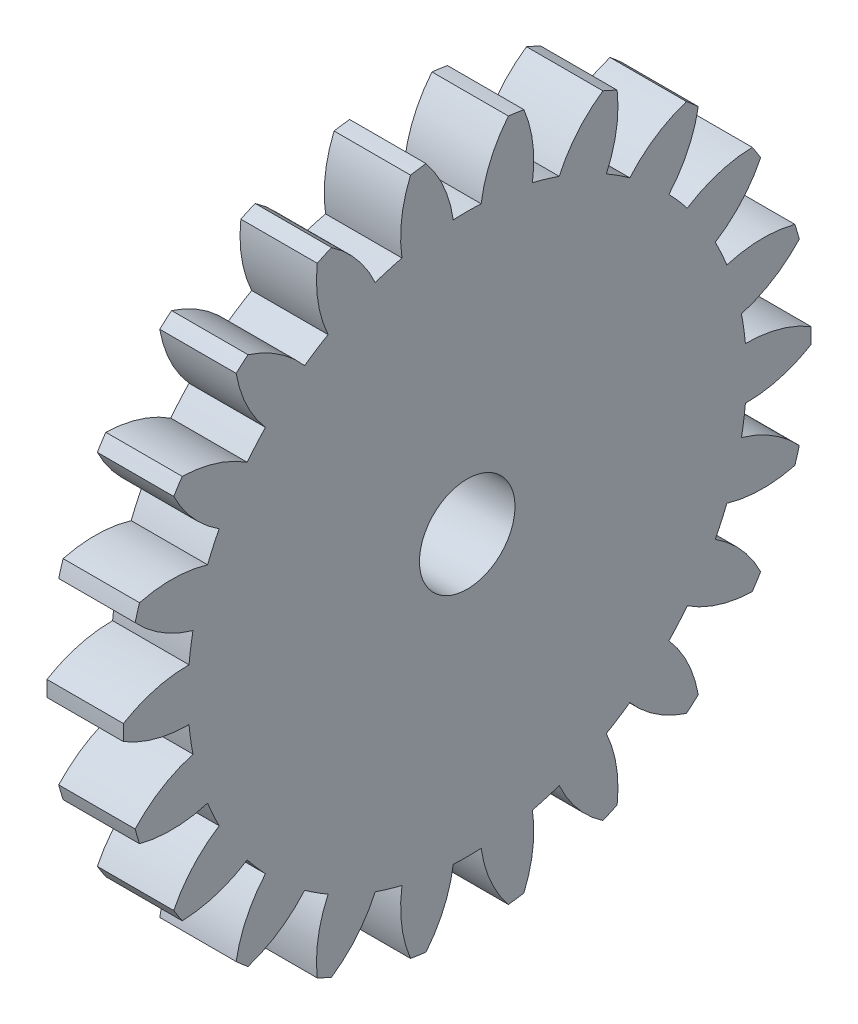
ISO-10303-21;
HEADER;
FILE_DESCRIPTION(('STEP AP214'),'2;1');
FILE_NAME('part.step','',(''),(''),'','','');
FILE_SCHEMA(('AUTOMOTIVE_DESIGN { 1 0 10303 214 1 1 1 1 }'));
ENDSEC;
DATA;
#1=APPLICATION_CONTEXT('core data for automotive mechanical design processes');
#2=APPLICATION_PROTOCOL_DEFINITION('international standard','automotive_design',2000,#1);
#3=PRODUCT_CONTEXT('',#1,'mechanical');
#4=PRODUCT('Part','Part','',(#3));
#5=PRODUCT_RELATED_PRODUCT_CATEGORY('part','',(#4));
#6=PRODUCT_DEFINITION_FORMATION('','',#4);
#7=PRODUCT_DEFINITION_CONTEXT('part definition',#1,'design');
#8=PRODUCT_DEFINITION('design','',#6,#7);
#9=PRODUCT_DEFINITION_SHAPE('','',#8);
#10=(LENGTH_UNIT() NAMED_UNIT(*) SI_UNIT(.MILLI.,.METRE.));
#11=(NAMED_UNIT(*) PLANE_ANGLE_UNIT() SI_UNIT($,.RADIAN.));
#12=(NAMED_UNIT(*) SI_UNIT($,.STERADIAN.) SOLID_ANGLE_UNIT());
#13=UNCERTAINTY_MEASURE_WITH_UNIT(LENGTH_MEASURE(1.E-05),#10,'distance_accuracy_value','');
#14=(GEOMETRIC_REPRESENTATION_CONTEXT(3) GLOBAL_UNCERTAINTY_ASSIGNED_CONTEXT((#13)) GLOBAL_UNIT_ASSIGNED_CONTEXT((#10,
#11,#12)) REPRESENTATION_CONTEXT('',''));
#15=CARTESIAN_POINT('',(0.,0.,0.));
#16=DIRECTION('',(0.,0.,1.));
#17=DIRECTION('',(1.,0.,0.));
#18=AXIS2_PLACEMENT_3D('',#15,#16,#17);
#19=CARTESIAN_POINT('',(4.,0.,0.));
#20=DIRECTION('',(-1.,0.,0.));
#21=DIRECTION('',(0.,0.,1.));
#22=AXIS2_PLACEMENT_3D('',#19,#20,#21);
#23=PLANE('',#22);
#24=CARTESIAN_POINT('',(4.,11.0940087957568,-10.8317020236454));
#25=DIRECTION('',(-1.,0.,0.));
#26=DIRECTION('',(0.,-0.281732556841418,-0.959492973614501));
#27=AXIS2_PLACEMENT_3D('',#24,#25,#26);
#28=CIRCLE('',#27,6.6);
#29=CARTESIAN_POINT('',(4.,13.8083480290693,-4.81569317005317));
#30=VERTEX_POINT('',#29);
#31=CARTESIAN_POINT('',(4.,16.5394780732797,-7.10251118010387));
#32=VERTEX_POINT('',#31);
#33=EDGE_CURVE('E574',#30,#32,#28,.T.);
#34=ORIENTED_EDGE('',*,*,#33,.F.);
#35=CARTESIAN_POINT('',(4.,0.,0.));
#36=DIRECTION('',(-1.,0.,0.));
#37=DIRECTION('',(0.,-0.281732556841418,-0.959492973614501));
#38=AXIS2_PLACEMENT_3D('',#35,#36,#37);
#39=CIRCLE('',#38,14.624);
#40=CARTESIAN_POINT('',(4.,14.21988185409,-3.41413767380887));
#41=VERTEX_POINT('',#40);
#42=EDGE_CURVE('E573',#41,#30,#39,.T.);
#43=ORIENTED_EDGE('',*,*,#42,.F.);
#44=CARTESIAN_POINT('',(4.,15.1889343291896,3.11433360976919));
#45=DIRECTION('',(-1.,0.,0.));
#46=DIRECTION('',(0.,-0.281732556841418,-0.959492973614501));
#47=AXIS2_PLACEMENT_3D('',#44,#45,#46);
#48=CIRCLE('',#47,6.6);
#49=CARTESIAN_POINT('',(4.,17.7538018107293,-2.96690432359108));
#50=VERTEX_POINT('',#49);
#51=EDGE_CURVE('E562',#50,#41,#48,.T.);
#52=ORIENTED_EDGE('',*,*,#51,.F.);
#53=CARTESIAN_POINT('',(4.,0.,0.));
#54=DIRECTION('',(-1.,0.,0.));
#55=DIRECTION('',(0.,0.,1.));
#56=AXIS2_PLACEMENT_3D('',#53,#54,#55);
#57=CIRCLE('',#56,18.);
#58=CARTESIAN_POINT('',(4.,17.8705216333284,-2.15510012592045));
#59=VERTEX_POINT('',#58);
#60=EDGE_CURVE('E1061',#59,#50,#57,.T.);
#61=ORIENTED_EDGE('',*,*,#60,.F.);
#62=CARTESIAN_POINT('',(4.,13.6962665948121,-7.267398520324));
#63=DIRECTION('',(-1.,0.,0.));
#64=DIRECTION('',(0.,0.,-1.));
#65=AXIS2_PLACEMENT_3D('',#62,#63,#64);
#66=CIRCLE('',#65,6.6);
#67=CARTESIAN_POINT('',(4.,14.6057504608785,-0.730362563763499));
#68=VERTEX_POINT('',#67);
#69=EDGE_CURVE('E1034',#68,#59,#66,.T.);
#70=ORIENTED_EDGE('',*,*,#69,.F.);
#71=CARTESIAN_POINT('',(4.,0.,0.));
#72=DIRECTION('',(-1.,0.,0.));
#73=DIRECTION('',(0.,0.,-1.));
#74=AXIS2_PLACEMENT_3D('',#71,#72,#73);
#75=CIRCLE('',#74,14.624);
#76=CARTESIAN_POINT('',(4.,14.6057504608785,0.7303625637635));
#77=VERTEX_POINT('',#76);
#78=EDGE_CURVE('E1039',#77,#68,#75,.T.);
#79=ORIENTED_EDGE('',*,*,#78,.F.);
#80=CARTESIAN_POINT('',(4.,13.6962665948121,7.267398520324));
#81=DIRECTION('',(-1.,0.,0.));
#82=DIRECTION('',(0.,0.,-1.));
#83=AXIS2_PLACEMENT_3D('',#80,#81,#82);
#84=CIRCLE('',#83,6.6);
#85=CARTESIAN_POINT('',(4.,17.8705216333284,2.15510012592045));
#86=VERTEX_POINT('',#85);
#87=EDGE_CURVE('E1036',#86,#77,#84,.T.);
#88=ORIENTED_EDGE('',*,*,#87,.F.);
#89=CARTESIAN_POINT('',(4.,17.7538018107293,2.96690432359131));
#90=VERTEX_POINT('',#89);
#91=EDGE_CURVE('E1059',#90,#86,#57,.T.);
#92=ORIENTED_EDGE('',*,*,#91,.F.);
#93=CARTESIAN_POINT('',(4.,15.1889343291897,-3.114333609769));
#94=DIRECTION('',(-1.,0.,0.));
#95=DIRECTION('',(0.,0.281732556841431,-0.959492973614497));
#96=AXIS2_PLACEMENT_3D('',#93,#94,#95);
#97=CIRCLE('',#96,6.6);
#98=CARTESIAN_POINT('',(4.,14.21988185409,3.41413767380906));
#99=VERTEX_POINT('',#98);
#100=EDGE_CURVE('E1012',#99,#90,#97,.T.);
#101=ORIENTED_EDGE('',*,*,#100,.F.);
#102=CARTESIAN_POINT('',(4.,0.,0.));
#103=DIRECTION('',(-1.,0.,0.));
#104=DIRECTION('',(0.,0.281732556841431,-0.959492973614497));
#105=AXIS2_PLACEMENT_3D('',#102,#103,#104);
#106=CIRCLE('',#105,14.624);
#107=CARTESIAN_POINT('',(4.,13.8083480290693,4.81569317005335));
#108=VERTEX_POINT('',#107);
#109=EDGE_CURVE('E1017',#108,#99,#106,.T.);
#110=ORIENTED_EDGE('',*,*,#109,.F.);
#111=CARTESIAN_POINT('',(4.,11.0940087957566,10.8317020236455));
#112=DIRECTION('',(-1.,0.,0.));
#113=DIRECTION('',(0.,0.281732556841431,-0.959492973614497));
#114=AXIS2_PLACEMENT_3D('',#111,#112,#113);
#115=CIRCLE('',#114,6.6);
#116=CARTESIAN_POINT('',(4.,16.5394780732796,7.10251118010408));
#117=VERTEX_POINT('',#116);
#118=EDGE_CURVE('E1014',#117,#108,#115,.T.);
#119=ORIENTED_EDGE('',*,*,#118,.F.);
#120=CARTESIAN_POINT('',(4.,16.1987745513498,7.84854782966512));
#121=VERTEX_POINT('',#120);
#122=EDGE_CURVE('E1223',#121,#117,#57,.T.);
#123=ORIENTED_EDGE('',*,*,#122,.F.);
#124=CARTESIAN_POINT('',(4.,15.4510849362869,1.29103608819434));
#125=DIRECTION('',(-1.,0.,0.));
#126=DIRECTION('',(0.,0.540640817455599,-0.841253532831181));
#127=AXIS2_PLACEMENT_3D('',#124,#125,#126);
#128=CIRCLE('',#127,6.6);
#129=CARTESIAN_POINT('',(4.,12.6820029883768,7.28204478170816));
#130=VERTEX_POINT('',#129);
#131=EDGE_CURVE('E990',#130,#121,#128,.T.);
#132=ORIENTED_EDGE('',*,*,#131,.F.);
#133=CARTESIAN_POINT('',(4.,0.,0.));
#134=DIRECTION('',(-1.,0.,0.));
#135=DIRECTION('',(0.,0.540640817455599,-0.841253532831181));
#136=AXIS2_PLACEMENT_3D('',#133,#134,#135);
#137=CIRCLE('',#136,14.624);
#138=CARTESIAN_POINT('',(4.,11.8922753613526,8.51088495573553));
#139=VERTEX_POINT('',#138);
#140=EDGE_CURVE('E995',#139,#130,#137,.T.);
#141=ORIENTED_EDGE('',*,*,#140,.F.);
#142=CARTESIAN_POINT('',(4.,7.59298038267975,13.5184854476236));
#143=DIRECTION('',(-1.,0.,0.));
#144=DIRECTION('',(0.,0.540640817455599,-0.841253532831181));
#145=AXIS2_PLACEMENT_3D('',#142,#143,#144);
#146=CIRCLE('',#145,6.6);
#147=CARTESIAN_POINT('',(4.,13.8685043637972,11.4745190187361));
#148=VERTEX_POINT('',#147);
#149=EDGE_CURVE('E992',#148,#139,#146,.T.);
#150=ORIENTED_EDGE('',*,*,#149,.F.);
#151=CARTESIAN_POINT('',(4.,13.3314189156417,12.0943486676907));
#152=VERTEX_POINT('',#151);
#153=EDGE_CURVE('E1218',#152,#148,#57,.T.);
#154=ORIENTED_EDGE('',*,*,#153,.F.);
#155=CARTESIAN_POINT('',(4.,14.4614805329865,5.59181372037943));
#156=DIRECTION('',(-1.,0.,0.));
#157=DIRECTION('',(0.,0.75574957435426,-0.654860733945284));
#158=AXIS2_PLACEMENT_3D('',#155,#156,#157);
#159=CIRCLE('',#158,6.6);
#160=CARTESIAN_POINT('',(4.,10.1167036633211,10.5600039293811));
#161=VERTEX_POINT('',#160);
#162=EDGE_CURVE('E968',#161,#152,#159,.T.);
#163=ORIENTED_EDGE('',*,*,#162,.F.);
#164=CARTESIAN_POINT('',(4.,0.,0.));
#165=DIRECTION('',(-1.,0.,0.));
#166=DIRECTION('',(0.,0.75574957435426,-0.654860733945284));
#167=AXIS2_PLACEMENT_3D('',#164,#165,#166);
#168=CIRCLE('',#167,14.624);
#169=CARTESIAN_POINT('',(4.,9.01276126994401,11.5165754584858));
#170=VERTEX_POINT('',#169);
#171=EDGE_CURVE('E973',#170,#161,#168,.T.);
#172=ORIENTED_EDGE('',*,*,#171,.F.);
#173=CARTESIAN_POINT('',(4.,3.47681385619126,15.1100815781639));
#174=DIRECTION('',(-1.,0.,0.));
#175=DIRECTION('',(0.,0.75574957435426,-0.654860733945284));
#176=AXIS2_PLACEMENT_3D('',#173,#174,#175);
#177=CIRCLE('',#176,6.6);
#178=CARTESIAN_POINT('',(4.,10.0739869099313,14.9169295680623));
#179=VERTEX_POINT('',#178);
#180=EDGE_CURVE('E970',#179,#170,#177,.T.);
#181=ORIENTED_EDGE('',*,*,#180,.F.);
#182=CARTESIAN_POINT('',(4.,9.38403100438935,15.360337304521));
#183=VERTEX_POINT('',#182);
#184=EDGE_CURVE('E1213',#183,#179,#57,.T.);
#185=ORIENTED_EDGE('',*,*,#184,.F.);
#186=CARTESIAN_POINT('',(4.,12.3002929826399,9.43957586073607));
#187=DIRECTION('',(-1.,0.,0.));
#188=DIRECTION('',(0.,0.90963199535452,-0.415415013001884));
#189=AXIS2_PLACEMENT_3D('',#186,#187,#188);
#190=CIRCLE('',#189,6.6);
#191=CARTESIAN_POINT('',(4.,6.73180917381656,12.9824543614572));
#192=VERTEX_POINT('',#191);
#193=EDGE_CURVE('E946',#192,#183,#190,.T.);
#194=ORIENTED_EDGE('',*,*,#193,.F.);
#195=CARTESIAN_POINT('',(4.,0.,0.));
#196=DIRECTION('',(-1.,0.,0.));
#197=DIRECTION('',(0.,0.90963199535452,-0.415415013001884));
#198=AXIS2_PLACEMENT_3D('',#195,#196,#197);
#199=CIRCLE('',#198,14.624);
#200=CARTESIAN_POINT('',(4.,5.40308686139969,13.589261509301));
#201=VERTEX_POINT('',#200);
#202=EDGE_CURVE('E951',#201,#192,#199,.T.);
#203=ORIENTED_EDGE('',*,*,#202,.F.);
#204=CARTESIAN_POINT('',(4.,-0.921023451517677,15.4775487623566));
#205=DIRECTION('',(-1.,0.,0.));
#206=DIRECTION('',(0.,0.90963199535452,-0.415415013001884));
#207=AXIS2_PLACEMENT_3D('',#204,#205,#206);
#208=CIRCLE('',#207,6.6);
#209=CARTESIAN_POINT('',(4.,5.46333494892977,17.1508591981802));
#210=VERTEX_POINT('',#209);
#211=EDGE_CURVE('E948',#210,#201,#208,.T.);
#212=ORIENTED_EDGE('',*,*,#211,.F.);
#213=CARTESIAN_POINT('',(4.,4.67640471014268,17.3819227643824));
#214=VERTEX_POINT('',#213);
#215=EDGE_CURVE('E1208',#214,#210,#57,.T.);
#216=ORIENTED_EDGE('',*,*,#215,.F.);
#217=CARTESIAN_POINT('',(4.,9.14260884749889,12.5225997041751));
#218=DIRECTION('',(-1.,0.,0.));
#219=DIRECTION('',(0.,0.989821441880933,-0.142314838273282));
#220=AXIS2_PLACEMENT_3D('',#217,#218,#219);
#221=CIRCLE('',#220,6.6);
#222=CARTESIAN_POINT('',(4.,2.80154354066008,14.353143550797));
#223=VERTEX_POINT('',#222);
#224=EDGE_CURVE('E924',#223,#214,#221,.T.);
#225=ORIENTED_EDGE('',*,*,#224,.F.);
#226=CARTESIAN_POINT('',(4.,0.,0.));
#227=DIRECTION('',(-1.,0.,0.));
#228=DIRECTION('',(0.,0.989821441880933,-0.142314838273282));
#229=AXIS2_PLACEMENT_3D('',#226,#227,#228);
#230=CIRCLE('',#229,14.624);
#231=CARTESIAN_POINT('',(4.,1.3556864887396,14.5610264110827));
#232=VERTEX_POINT('',#231);
#233=EDGE_CURVE('E929',#232,#223,#230,.T.);
#234=ORIENTED_EDGE('',*,*,#233,.F.);
#235=CARTESIAN_POINT('',(4.,-5.24424491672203,14.5911169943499));
#236=DIRECTION('',(-1.,0.,0.));
#237=DIRECTION('',(0.,0.989821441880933,-0.142314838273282));
#238=AXIS2_PLACEMENT_3D('',#235,#236,#237);
#239=CIRCLE('',#238,6.6);
#240=CARTESIAN_POINT('',(4.,0.41007608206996,17.9953282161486));
#241=VERTEX_POINT('',#240);
#242=EDGE_CURVE('E926',#241,#232,#239,.T.);
#243=ORIENTED_EDGE('',*,*,#242,.F.);
#244=CARTESIAN_POINT('',(4.,-0.410076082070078,17.9953282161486));
#245=VERTEX_POINT('',#244);
#246=EDGE_CURVE('E1203',#245,#241,#57,.T.);
#247=ORIENTED_EDGE('',*,*,#246,.F.);
#248=CARTESIAN_POINT('',(4.,5.24424491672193,14.59111699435));
#249=DIRECTION('',(-1.,0.,0.));
#250=DIRECTION('',(0.,0.989821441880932,0.142314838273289));
#251=AXIS2_PLACEMENT_3D('',#248,#249,#250);
#252=CIRCLE('',#251,6.6);
#253=CARTESIAN_POINT('',(4.,-1.3556864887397,14.5610264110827));
#254=VERTEX_POINT('',#253);
#255=EDGE_CURVE('E902',#254,#245,#252,.T.);
#256=ORIENTED_EDGE('',*,*,#255,.F.);
#257=CARTESIAN_POINT('',(4.,0.,0.));
#258=DIRECTION('',(-1.,0.,0.));
#259=DIRECTION('',(0.,0.989821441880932,0.142314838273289));
#260=AXIS2_PLACEMENT_3D('',#257,#258,#259);
#261=CIRCLE('',#260,14.624);
#262=CARTESIAN_POINT('',(4.,-2.80154354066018,14.353143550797));
#263=VERTEX_POINT('',#262);
#264=EDGE_CURVE('E907',#263,#254,#261,.T.);
#265=ORIENTED_EDGE('',*,*,#264,.F.);
#266=CARTESIAN_POINT('',(4.,-9.14260884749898,12.5225997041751));
#267=DIRECTION('',(-1.,0.,0.));
#268=DIRECTION('',(0.,0.989821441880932,0.142314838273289));
#269=AXIS2_PLACEMENT_3D('',#266,#267,#268);
#270=CIRCLE('',#269,6.6);
#271=CARTESIAN_POINT('',(4.,-4.67640471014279,17.3819227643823));
#272=VERTEX_POINT('',#271);
#273=EDGE_CURVE('E904',#272,#263,#270,.T.);
#274=ORIENTED_EDGE('',*,*,#273,.F.);
#275=CARTESIAN_POINT('',(4.,-5.46333494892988,17.1508591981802));
#276=VERTEX_POINT('',#275);
#277=EDGE_CURVE('E1198',#276,#272,#57,.T.);
#278=ORIENTED_EDGE('',*,*,#277,.F.);
#279=CARTESIAN_POINT('',(4.,0.921023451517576,15.4775487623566));
#280=DIRECTION('',(-1.,0.,0.));
#281=DIRECTION('',(0.,0.909631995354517,0.41541501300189));
#282=AXIS2_PLACEMENT_3D('',#279,#280,#281);
#283=CIRCLE('',#282,6.6);
#284=CARTESIAN_POINT('',(4.,-5.40308686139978,13.589261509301));
#285=VERTEX_POINT('',#284);
#286=EDGE_CURVE('E880',#285,#276,#283,.T.);
#287=ORIENTED_EDGE('',*,*,#286,.F.);
#288=CARTESIAN_POINT('',(4.,0.,0.));
#289=DIRECTION('',(-1.,0.,0.));
#290=DIRECTION('',(0.,0.909631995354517,0.41541501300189));
#291=AXIS2_PLACEMENT_3D('',#288,#289,#290);
#292=CIRCLE('',#291,14.624);
#293=CARTESIAN_POINT('',(4.,-6.73180917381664,12.9824543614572));
#294=VERTEX_POINT('',#293);
#295=EDGE_CURVE('E885',#294,#285,#292,.T.);
#296=ORIENTED_EDGE('',*,*,#295,.F.);
#297=CARTESIAN_POINT('',(4.,-12.30029298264,9.43957586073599));
#298=DIRECTION('',(-1.,0.,0.));
#299=DIRECTION('',(0.,0.909631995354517,0.41541501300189));
#300=AXIS2_PLACEMENT_3D('',#297,#298,#299);
#301=CIRCLE('',#300,6.6);
#302=CARTESIAN_POINT('',(4.,-9.38403100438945,15.360337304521));
#303=VERTEX_POINT('',#302);
#304=EDGE_CURVE('E882',#303,#294,#301,.T.);
#305=ORIENTED_EDGE('',*,*,#304,.F.);
#306=CARTESIAN_POINT('',(4.,-10.0739869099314,14.9169295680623));
#307=VERTEX_POINT('',#306);
#308=EDGE_CURVE('E1193',#307,#303,#57,.T.);
#309=ORIENTED_EDGE('',*,*,#308,.F.);
#310=CARTESIAN_POINT('',(4.,-3.47681385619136,15.1100815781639));
#311=DIRECTION('',(-1.,0.,0.));
#312=DIRECTION('',(0.,0.755749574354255,0.654860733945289));
#313=AXIS2_PLACEMENT_3D('',#310,#311,#312);
#314=CIRCLE('',#313,6.6);
#315=CARTESIAN_POINT('',(4.,-9.01276126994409,11.5165754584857));
#316=VERTEX_POINT('',#315);
#317=EDGE_CURVE('E858',#316,#307,#314,.T.);
#318=ORIENTED_EDGE('',*,*,#317,.F.);
#319=CARTESIAN_POINT('',(4.,0.,0.));
#320=DIRECTION('',(-1.,0.,0.));
#321=DIRECTION('',(0.,0.755749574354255,0.654860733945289));
#322=AXIS2_PLACEMENT_3D('',#319,#320,#321);
#323=CIRCLE('',#322,14.624);
#324=CARTESIAN_POINT('',(4.,-10.1167036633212,10.5600039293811));
#325=VERTEX_POINT('',#324);
#326=EDGE_CURVE('E863',#325,#316,#323,.T.);
#327=ORIENTED_EDGE('',*,*,#326,.F.);
#328=CARTESIAN_POINT('',(4.,-14.4614805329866,5.59181372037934));
#329=DIRECTION('',(-1.,0.,0.));
#330=DIRECTION('',(0.,0.755749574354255,0.654860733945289));
#331=AXIS2_PLACEMENT_3D('',#328,#329,#330);
#332=CIRCLE('',#331,6.6);
#333=CARTESIAN_POINT('',(4.,-13.3314189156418,12.0943486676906));
#334=VERTEX_POINT('',#333);
#335=EDGE_CURVE('E860',#334,#325,#332,.T.);
#336=ORIENTED_EDGE('',*,*,#335,.F.);
#337=CARTESIAN_POINT('',(4.,-13.8685043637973,11.474519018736));
#338=VERTEX_POINT('',#337);
#339=EDGE_CURVE('E1188',#338,#334,#57,.T.);
#340=ORIENTED_EDGE('',*,*,#339,.F.);
#341=CARTESIAN_POINT('',(4.,-7.59298038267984,13.5184854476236));
#342=DIRECTION('',(-1.,0.,0.));
#343=DIRECTION('',(0.,0.540640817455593,0.841253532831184));
#344=AXIS2_PLACEMENT_3D('',#341,#342,#343);
#345=CIRCLE('',#344,6.6);
#346=CARTESIAN_POINT('',(4.,-11.8922753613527,8.51088495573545));
#347=VERTEX_POINT('',#346);
#348=EDGE_CURVE('E836',#347,#338,#345,.T.);
#349=ORIENTED_EDGE('',*,*,#348,.F.);
#350=CARTESIAN_POINT('',(4.,0.,0.));
#351=DIRECTION('',(-1.,0.,0.));
#352=DIRECTION('',(0.,0.540640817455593,0.841253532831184));
#353=AXIS2_PLACEMENT_3D('',#350,#351,#352);
#354=CIRCLE('',#353,14.624);
#355=CARTESIAN_POINT('',(4.,-12.6820029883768,7.28204478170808));
#356=VERTEX_POINT('',#355);
#357=EDGE_CURVE('E841',#356,#347,#354,.T.);
#358=ORIENTED_EDGE('',*,*,#357,.F.);
#359=CARTESIAN_POINT('',(4.,-15.4510849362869,1.29103608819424));
#360=DIRECTION('',(-1.,0.,0.));
#361=DIRECTION('',(0.,0.540640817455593,0.841253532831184));
#362=AXIS2_PLACEMENT_3D('',#359,#360,#361);
#363=CIRCLE('',#362,6.6);
#364=CARTESIAN_POINT('',(4.,-16.1987745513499,7.848547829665));
#365=VERTEX_POINT('',#364);
#366=EDGE_CURVE('E838',#365,#356,#363,.T.);
#367=ORIENTED_EDGE('',*,*,#366,.F.);
#368=CARTESIAN_POINT('',(4.,-16.5394780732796,7.10251118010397));
#369=VERTEX_POINT('',#368);
#370=EDGE_CURVE('E1183',#369,#365,#57,.T.);
#371=ORIENTED_EDGE('',*,*,#370,.F.);
#372=CARTESIAN_POINT('',(4.,-11.0940087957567,10.8317020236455));
#373=DIRECTION('',(-1.,0.,0.));
#374=DIRECTION('',(0.,0.281732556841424,0.959492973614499));
#375=AXIS2_PLACEMENT_3D('',#372,#373,#374);
#376=CIRCLE('',#375,6.6);
#377=CARTESIAN_POINT('',(4.,-13.8083480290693,4.81569317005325));
#378=VERTEX_POINT('',#377);
#379=EDGE_CURVE('E814',#378,#369,#376,.T.);
#380=ORIENTED_EDGE('',*,*,#379,.F.);
#381=CARTESIAN_POINT('',(4.,0.,0.));
#382=DIRECTION('',(-1.,0.,0.));
#383=DIRECTION('',(0.,0.281732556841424,0.959492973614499));
#384=AXIS2_PLACEMENT_3D('',#381,#382,#383);
#385=CIRCLE('',#384,14.624);
#386=CARTESIAN_POINT('',(4.,-14.21988185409,3.41413767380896));
#387=VERTEX_POINT('',#386);
#388=EDGE_CURVE('E819',#387,#378,#385,.T.);
#389=ORIENTED_EDGE('',*,*,#388,.F.);
#390=CARTESIAN_POINT('',(4.,-15.1889343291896,-3.1143336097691));
#391=DIRECTION('',(-1.,0.,0.));
#392=DIRECTION('',(0.,0.281732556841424,0.959492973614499));
#393=AXIS2_PLACEMENT_3D('',#390,#391,#392);
#394=CIRCLE('',#393,6.6);
#395=CARTESIAN_POINT('',(4.,-17.7538018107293,2.96690432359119));
#396=VERTEX_POINT('',#395);
#397=EDGE_CURVE('E816',#396,#387,#394,.T.);
#398=ORIENTED_EDGE('',*,*,#397,.F.);
#399=CARTESIAN_POINT('',(4.,-17.8705216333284,2.15510012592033));
#400=VERTEX_POINT('',#399);
#401=EDGE_CURVE('E1178',#400,#396,#57,.T.);
#402=ORIENTED_EDGE('',*,*,#401,.F.);
#403=CARTESIAN_POINT('',(4.,-13.6962665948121,7.26739852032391));
#404=DIRECTION('',(-1.,0.,0.));
#405=DIRECTION('',(0.,0.,1.));
#406=AXIS2_PLACEMENT_3D('',#403,#404,#405);
#407=CIRCLE('',#406,6.6);
#408=CARTESIAN_POINT('',(4.,-14.6057504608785,0.730362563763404));
#409=VERTEX_POINT('',#408);
#410=EDGE_CURVE('E792',#409,#400,#407,.T.);
#411=ORIENTED_EDGE('',*,*,#410,.F.);
#412=CARTESIAN_POINT('',(4.,0.,0.));
#413=DIRECTION('',(-1.,0.,0.));
#414=DIRECTION('',(0.,0.,1.));
#415=AXIS2_PLACEMENT_3D('',#412,#413,#414);
#416=CIRCLE('',#415,14.624);
#417=CARTESIAN_POINT('',(4.,-14.6057504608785,-0.730362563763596));
#418=VERTEX_POINT('',#417);
#419=EDGE_CURVE('E797',#418,#409,#416,.T.);
#420=ORIENTED_EDGE('',*,*,#419,.F.);
#421=CARTESIAN_POINT('',(4.,-13.696266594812,-7.26739852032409));
#422=DIRECTION('',(-1.,0.,0.));
#423=DIRECTION('',(0.,0.,1.));
#424=AXIS2_PLACEMENT_3D('',#421,#422,#423);
#425=CIRCLE('',#424,6.6);
#426=CARTESIAN_POINT('',(4.,-17.8705216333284,-2.15510012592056));
#427=VERTEX_POINT('',#426);
#428=EDGE_CURVE('E794',#427,#418,#425,.T.);
#429=ORIENTED_EDGE('',*,*,#428,.F.);
#430=CARTESIAN_POINT('',(4.,-17.7538018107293,-2.96690432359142));
#431=VERTEX_POINT('',#430);
#432=EDGE_CURVE('E1173',#431,#427,#57,.T.);
#433=ORIENTED_EDGE('',*,*,#432,.F.);
#434=CARTESIAN_POINT('',(4.,-15.1889343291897,3.1143336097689));
#435=DIRECTION('',(-1.,0.,0.));
#436=DIRECTION('',(0.,-0.281732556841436,0.959492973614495));
#437=AXIS2_PLACEMENT_3D('',#434,#435,#436);
#438=CIRCLE('',#437,6.6);
#439=CARTESIAN_POINT('',(4.,-14.21988185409,-3.41413767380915));
#440=VERTEX_POINT('',#439);
#441=EDGE_CURVE('E770',#440,#431,#438,.T.);
#442=ORIENTED_EDGE('',*,*,#441,.F.);
#443=CARTESIAN_POINT('',(4.,0.,0.));
#444=DIRECTION('',(-1.,0.,0.));
#445=DIRECTION('',(0.,-0.281732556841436,0.959492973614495));
#446=AXIS2_PLACEMENT_3D('',#443,#444,#445);
#447=CIRCLE('',#446,14.624);
#448=CARTESIAN_POINT('',(4.,-13.8083480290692,-4.81569317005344));
#449=VERTEX_POINT('',#448);
#450=EDGE_CURVE('E775',#449,#440,#447,.T.);
#451=ORIENTED_EDGE('',*,*,#450,.F.);
#452=CARTESIAN_POINT('',(4.,-11.0940087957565,-10.8317020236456));
#453=DIRECTION('',(-1.,0.,0.));
#454=DIRECTION('',(0.,-0.281732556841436,0.959492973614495));
#455=AXIS2_PLACEMENT_3D('',#452,#453,#454);
#456=CIRCLE('',#455,6.6);
#457=CARTESIAN_POINT('',(4.,-16.5394780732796,-7.10251118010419));
#458=VERTEX_POINT('',#457);
#459=EDGE_CURVE('E772',#458,#449,#456,.T.);
#460=ORIENTED_EDGE('',*,*,#459,.F.);
#461=CARTESIAN_POINT('',(4.,-16.1987745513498,-7.84854782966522));
#462=VERTEX_POINT('',#461);
#463=EDGE_CURVE('E1168',#462,#458,#57,.T.);
#464=ORIENTED_EDGE('',*,*,#463,.F.);
#465=CARTESIAN_POINT('',(4.,-15.4510849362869,-1.29103608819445));
#466=DIRECTION('',(-1.,0.,0.));
#467=DIRECTION('',(0.,-0.540640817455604,0.841253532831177));
#468=AXIS2_PLACEMENT_3D('',#465,#466,#467);
#469=CIRCLE('',#468,6.6);
#470=CARTESIAN_POINT('',(4.,-12.6820029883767,-7.28204478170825));
#471=VERTEX_POINT('',#470);
#472=EDGE_CURVE('E748',#471,#462,#469,.T.);
#473=ORIENTED_EDGE('',*,*,#472,.F.);
#474=CARTESIAN_POINT('',(4.,0.,0.));
#475=DIRECTION('',(-1.,0.,0.));
#476=DIRECTION('',(0.,-0.540640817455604,0.841253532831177));
#477=AXIS2_PLACEMENT_3D('',#474,#475,#476);
#478=CIRCLE('',#477,14.624);
#479=CARTESIAN_POINT('',(4.,-11.8922753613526,-8.51088495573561));
#480=VERTEX_POINT('',#479);
#481=EDGE_CURVE('E753',#480,#471,#478,.T.);
#482=ORIENTED_EDGE('',*,*,#481,.F.);
#483=CARTESIAN_POINT('',(4.,-7.59298038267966,-13.5184854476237));
#484=DIRECTION('',(-1.,0.,0.));
#485=DIRECTION('',(0.,-0.540640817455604,0.841253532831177));
#486=AXIS2_PLACEMENT_3D('',#483,#484,#485);
#487=CIRCLE('',#486,6.6);
#488=CARTESIAN_POINT('',(4.,-13.8685043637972,-11.4745190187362));
#489=VERTEX_POINT('',#488);
#490=EDGE_CURVE('E750',#489,#480,#487,.T.);
#491=ORIENTED_EDGE('',*,*,#490,.F.);
#492=CARTESIAN_POINT('',(4.,-13.3314189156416,-12.0943486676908));
#493=VERTEX_POINT('',#492);
#494=EDGE_CURVE('E1163',#493,#489,#57,.T.);
#495=ORIENTED_EDGE('',*,*,#494,.F.);
#496=CARTESIAN_POINT('',(4.,-14.4614805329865,-5.59181372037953));
#497=DIRECTION('',(-1.,0.,0.));
#498=DIRECTION('',(0.,-0.755749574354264,0.654860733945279));
#499=AXIS2_PLACEMENT_3D('',#496,#497,#498);
#500=CIRCLE('',#499,6.6);
#501=CARTESIAN_POINT('',(4.,-10.116703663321,-10.5600039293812));
#502=VERTEX_POINT('',#501);
#503=EDGE_CURVE('E726',#502,#493,#500,.T.);
#504=ORIENTED_EDGE('',*,*,#503,.F.);
#505=CARTESIAN_POINT('',(4.,0.,0.));
#506=DIRECTION('',(-1.,0.,0.));
#507=DIRECTION('',(0.,-0.755749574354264,0.654860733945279));
#508=AXIS2_PLACEMENT_3D('',#505,#506,#507);
#509=CIRCLE('',#508,14.624);
#510=CARTESIAN_POINT('',(4.,-9.01276126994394,-11.5165754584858));
#511=VERTEX_POINT('',#510);
#512=EDGE_CURVE('E731',#511,#502,#509,.T.);
#513=ORIENTED_EDGE('',*,*,#512,.F.);
#514=CARTESIAN_POINT('',(4.,-3.47681385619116,-15.1100815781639));
#515=DIRECTION('',(-1.,0.,0.));
#516=DIRECTION('',(0.,-0.755749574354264,0.654860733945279));
#517=AXIS2_PLACEMENT_3D('',#514,#515,#516);
#518=CIRCLE('',#517,6.6);
#519=CARTESIAN_POINT('',(4.,-10.0739869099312,-14.9169295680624));
#520=VERTEX_POINT('',#519);
#521=EDGE_CURVE('E728',#520,#511,#518,.T.);
#522=ORIENTED_EDGE('',*,*,#521,.F.);
#523=CARTESIAN_POINT('',(4.,-9.38403100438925,-15.3603373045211));
#524=VERTEX_POINT('',#523);
#525=EDGE_CURVE('E1158',#524,#520,#57,.T.);
#526=ORIENTED_EDGE('',*,*,#525,.F.);
#527=CARTESIAN_POINT('',(4.,-12.3002929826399,-9.43957586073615));
#528=DIRECTION('',(-1.,0.,0.));
#529=DIRECTION('',(0.,-0.909631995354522,0.415415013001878));
#530=AXIS2_PLACEMENT_3D('',#527,#528,#529);
#531=CIRCLE('',#530,6.6);
#532=CARTESIAN_POINT('',(4.,-6.73180917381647,-12.9824543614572));
#533=VERTEX_POINT('',#532);
#534=EDGE_CURVE('E704',#533,#524,#531,.T.);
#535=ORIENTED_EDGE('',*,*,#534,.F.);
#536=CARTESIAN_POINT('',(4.,0.,0.));
#537=DIRECTION('',(-1.,0.,0.));
#538=DIRECTION('',(0.,-0.909631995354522,0.415415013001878));
#539=AXIS2_PLACEMENT_3D('',#536,#537,#538);
#540=CIRCLE('',#539,14.624);
#541=CARTESIAN_POINT('',(4.,-5.4030868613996,-13.589261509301));
#542=VERTEX_POINT('',#541);
#543=EDGE_CURVE('E709',#542,#533,#540,.T.);
#544=ORIENTED_EDGE('',*,*,#543,.F.);
#545=CARTESIAN_POINT('',(4.,0.921023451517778,-15.4775487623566));
#546=DIRECTION('',(-1.,0.,0.));
#547=DIRECTION('',(0.,-0.909631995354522,0.415415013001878));
#548=AXIS2_PLACEMENT_3D('',#545,#546,#547);
#549=CIRCLE('',#548,6.6);
#550=CARTESIAN_POINT('',(4.,-5.46333494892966,-17.1508591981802));
#551=VERTEX_POINT('',#550);
#552=EDGE_CURVE('E706',#551,#542,#549,.T.);
#553=ORIENTED_EDGE('',*,*,#552,.F.);
#554=CARTESIAN_POINT('',(4.,-4.67640471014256,-17.3819227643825));
#555=VERTEX_POINT('',#554);
#556=EDGE_CURVE('E1153',#555,#551,#57,.T.);
#557=ORIENTED_EDGE('',*,*,#556,.F.);
#558=CARTESIAN_POINT('',(4.,-9.14260884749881,-12.5225997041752));
#559=DIRECTION('',(-1.,0.,0.));
#560=DIRECTION('',(0.,-0.989821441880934,0.142314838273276));
#561=AXIS2_PLACEMENT_3D('',#558,#559,#560);
#562=CIRCLE('',#561,6.6);
#563=CARTESIAN_POINT('',(4.,-2.80154354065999,-14.353143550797));
#564=VERTEX_POINT('',#563);
#565=EDGE_CURVE('E682',#564,#555,#562,.T.);
#566=ORIENTED_EDGE('',*,*,#565,.F.);
#567=CARTESIAN_POINT('',(4.,0.,0.));
#568=DIRECTION('',(-1.,0.,0.));
#569=DIRECTION('',(0.,-0.989821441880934,0.142314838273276));
#570=AXIS2_PLACEMENT_3D('',#567,#568,#569);
#571=CIRCLE('',#570,14.624);
#572=CARTESIAN_POINT('',(4.,-1.3556864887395,-14.5610264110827));
#573=VERTEX_POINT('',#572);
#574=EDGE_CURVE('E687',#573,#564,#571,.T.);
#575=ORIENTED_EDGE('',*,*,#574,.F.);
#576=CARTESIAN_POINT('',(4.,5.24424491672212,-14.5911169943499));
#577=DIRECTION('',(-1.,0.,0.));
#578=DIRECTION('',(0.,-0.989821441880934,0.142314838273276));
#579=AXIS2_PLACEMENT_3D('',#576,#577,#578);
#580=CIRCLE('',#579,6.6);
#581=CARTESIAN_POINT('',(4.,-0.410076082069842,-17.9953282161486));
#582=VERTEX_POINT('',#581);
#583=EDGE_CURVE('E684',#582,#573,#580,.T.);
#584=ORIENTED_EDGE('',*,*,#583,.F.);
#585=CARTESIAN_POINT('',(4.,0.410076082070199,-17.9953282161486));
#586=VERTEX_POINT('',#585);
#587=EDGE_CURVE('E1148',#586,#582,#57,.T.);
#588=ORIENTED_EDGE('',*,*,#587,.F.);
#589=CARTESIAN_POINT('',(4.,-5.24424491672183,-14.59111699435));
#590=DIRECTION('',(-1.,0.,0.));
#591=DIRECTION('',(0.,-0.989821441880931,-0.142314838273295));
#592=AXIS2_PLACEMENT_3D('',#589,#590,#591);
#593=CIRCLE('',#592,6.6);
#594=CARTESIAN_POINT('',(4.,1.35568648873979,-14.5610264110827));
#595=VERTEX_POINT('',#594);
#596=EDGE_CURVE('E660',#595,#586,#593,.T.);
#597=ORIENTED_EDGE('',*,*,#596,.F.);
#598=CARTESIAN_POINT('',(4.,0.,0.));
#599=DIRECTION('',(-1.,0.,0.));
#600=DIRECTION('',(0.,-0.989821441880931,-0.142314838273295));
#601=AXIS2_PLACEMENT_3D('',#598,#599,#600);
#602=CIRCLE('',#601,14.624);
#603=CARTESIAN_POINT('',(4.,2.80154354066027,-14.353143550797));
#604=VERTEX_POINT('',#603);
#605=EDGE_CURVE('E665',#604,#595,#602,.T.);
#606=ORIENTED_EDGE('',*,*,#605,.F.);
#607=CARTESIAN_POINT('',(4.,9.14260884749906,-12.522599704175));
#608=DIRECTION('',(-1.,0.,0.));
#609=DIRECTION('',(0.,-0.989821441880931,-0.142314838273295));
#610=AXIS2_PLACEMENT_3D('',#607,#608,#609);
#611=CIRCLE('',#610,6.6);
#612=CARTESIAN_POINT('',(4.,4.67640471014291,-17.3819227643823));
#613=VERTEX_POINT('',#612);
#614=EDGE_CURVE('E662',#613,#604,#611,.T.);
#615=ORIENTED_EDGE('',*,*,#614,.F.);
#616=CARTESIAN_POINT('',(4.,5.46333494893,-17.1508591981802));
#617=VERTEX_POINT('',#616);
#618=EDGE_CURVE('E1143',#617,#613,#57,.T.);
#619=ORIENTED_EDGE('',*,*,#618,.F.);
#620=CARTESIAN_POINT('',(4.,-0.921023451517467,-15.4775487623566));
#621=DIRECTION('',(-1.,0.,0.));
#622=DIRECTION('',(0.,-0.909631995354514,-0.415415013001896));
#623=AXIS2_PLACEMENT_3D('',#620,#621,#622);
#624=CIRCLE('',#623,6.6);
#625=CARTESIAN_POINT('',(4.,5.40308686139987,-13.5892615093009));
#626=VERTEX_POINT('',#625);
#627=EDGE_CURVE('E638',#626,#617,#624,.T.);
#628=ORIENTED_EDGE('',*,*,#627,.F.);
#629=CARTESIAN_POINT('',(4.,0.,0.));
#630=DIRECTION('',(-1.,0.,0.));
#631=DIRECTION('',(0.,-0.909631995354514,-0.415415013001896));
#632=AXIS2_PLACEMENT_3D('',#629,#630,#631);
#633=CIRCLE('',#632,14.624);
#634=CARTESIAN_POINT('',(4.,6.73180917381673,-12.9824543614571));
#635=VERTEX_POINT('',#634);
#636=EDGE_CURVE('E643',#635,#626,#633,.T.);
#637=ORIENTED_EDGE('',*,*,#636,.F.);
#638=CARTESIAN_POINT('',(4.,12.30029298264,-9.4395758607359));
#639=DIRECTION('',(-1.,0.,0.));
#640=DIRECTION('',(0.,-0.909631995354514,-0.415415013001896));
#641=AXIS2_PLACEMENT_3D('',#638,#639,#640);
#642=CIRCLE('',#641,6.6);
#643=CARTESIAN_POINT('',(4.,9.38403100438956,-15.3603373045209));
#644=VERTEX_POINT('',#643);
#645=EDGE_CURVE('E640',#644,#635,#642,.T.);
#646=ORIENTED_EDGE('',*,*,#645,.F.);
#647=CARTESIAN_POINT('',(4.,10.0739869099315,-14.9169295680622));
#648=VERTEX_POINT('',#647);
#649=EDGE_CURVE('E1138',#648,#644,#57,.T.);
#650=ORIENTED_EDGE('',*,*,#649,.F.);
#651=CARTESIAN_POINT('',(4.,3.47681385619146,-15.1100815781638));
#652=DIRECTION('',(-1.,0.,0.));
#653=DIRECTION('',(0.,-0.755749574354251,-0.654860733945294));
#654=AXIS2_PLACEMENT_3D('',#651,#652,#653);
#655=CIRCLE('',#654,6.6);
#656=CARTESIAN_POINT('',(4.,9.01276126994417,-11.5165754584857));
#657=VERTEX_POINT('',#656);
#658=EDGE_CURVE('E616',#657,#648,#655,.T.);
#659=ORIENTED_EDGE('',*,*,#658,.F.);
#660=CARTESIAN_POINT('',(4.,0.,0.));
#661=DIRECTION('',(-1.,0.,0.));
#662=DIRECTION('',(0.,-0.755749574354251,-0.654860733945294));
#663=AXIS2_PLACEMENT_3D('',#660,#661,#662);
#664=CIRCLE('',#663,14.624);
#665=CARTESIAN_POINT('',(4.,10.1167036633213,-10.560003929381));
#666=VERTEX_POINT('',#665);
#667=EDGE_CURVE('E621',#666,#657,#664,.T.);
#668=ORIENTED_EDGE('',*,*,#667,.F.);
#669=CARTESIAN_POINT('',(4.,14.4614805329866,-5.59181372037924));
#670=DIRECTION('',(-1.,0.,0.));
#671=DIRECTION('',(0.,-0.755749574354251,-0.654860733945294));
#672=AXIS2_PLACEMENT_3D('',#669,#670,#671);
#673=CIRCLE('',#672,6.6);
#674=CARTESIAN_POINT('',(4.,13.3314189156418,-12.0943486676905));
#675=VERTEX_POINT('',#674);
#676=EDGE_CURVE('E618',#675,#666,#673,.T.);
#677=ORIENTED_EDGE('',*,*,#676,.F.);
#678=CARTESIAN_POINT('',(4.,13.8685043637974,-11.4745190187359));
#679=VERTEX_POINT('',#678);
#680=EDGE_CURVE('E1137',#679,#675,#57,.T.);
#681=ORIENTED_EDGE('',*,*,#680,.F.);
#682=CARTESIAN_POINT('',(4.,7.59298038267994,-13.5184854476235));
#683=DIRECTION('',(-1.,0.,0.));
#684=DIRECTION('',(0.,-0.540640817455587,-0.841253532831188));
#685=AXIS2_PLACEMENT_3D('',#682,#683,#684);
#686=CIRCLE('',#685,6.6);
#687=CARTESIAN_POINT('',(4.,11.8922753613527,-8.51088495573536));
#688=VERTEX_POINT('',#687);
#689=EDGE_CURVE('E596',#688,#679,#686,.T.);
#690=ORIENTED_EDGE('',*,*,#689,.F.);
#691=CARTESIAN_POINT('',(4.,0.,0.));
#692=DIRECTION('',(-1.,0.,0.));
#693=DIRECTION('',(0.,-0.540640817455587,-0.841253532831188));
#694=AXIS2_PLACEMENT_3D('',#691,#692,#693);
#695=CIRCLE('',#694,14.624);
#696=CARTESIAN_POINT('',(4.,12.6820029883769,-7.28204478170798));
#697=VERTEX_POINT('',#696);
#698=EDGE_CURVE('E601',#697,#688,#695,.T.);
#699=ORIENTED_EDGE('',*,*,#698,.F.);
#700=CARTESIAN_POINT('',(4.,15.4510849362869,-1.29103608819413));
#701=DIRECTION('',(-1.,0.,0.));
#702=DIRECTION('',(0.,-0.540640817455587,-0.841253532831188));
#703=AXIS2_PLACEMENT_3D('',#700,#701,#702);
#704=CIRCLE('',#703,6.6);
#705=CARTESIAN_POINT('',(4.,16.19877455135,-7.84854782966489));
#706=VERTEX_POINT('',#705);
#707=EDGE_CURVE('E598',#706,#697,#704,.T.);
#708=ORIENTED_EDGE('',*,*,#707,.F.);
#709=EDGE_CURVE('E1064',#32,#706,#57,.T.);
#710=ORIENTED_EDGE('',*,*,#709,.F.);
#711=EDGE_LOOP('',(#34,#43,#52,#61,#70,#79,#88,#92,#101,#110,#119,#123,#132,#141,#150,#154,#163,
#172,#181,#185,#194,#203,#212,#216,#225,#234,#243,#247,#256,#265,#274,#278,#287,#296,#305,#309,
#318,#327,#336,#340,#349,#358,#367,#371,#380,#389,#398,#402,#411,#420,#429,#433,#442,#451,#460,
#464,#473,#482,#491,#495,#504,#513,#522,#526,#535,#544,#553,#557,#566,#575,#584,#588,#597,#606,
#615,#619,#628,#637,#646,#650,#659,#668,#677,#681,#690,#699,#708,#710));
#712=FACE_BOUND('',#711,.T.);
#713=CARTESIAN_POINT('',(4.,0.,0.));
#714=DIRECTION('',(-1.,0.,0.));
#715=DIRECTION('',(0.,0.,1.));
#716=AXIS2_PLACEMENT_3D('',#713,#714,#715);
#717=CIRCLE('',#716,2.5);
#718=CARTESIAN_POINT('',(4.,0.,2.5));
#719=VERTEX_POINT('',#718);
#720=EDGE_CURVE('E591',#719,#719,#717,.F.);
#721=ORIENTED_EDGE('',*,*,#720,.F.);
#722=EDGE_LOOP('',(#721));
#723=FACE_BOUND('',#722,.T.);
#724=ADVANCED_FACE('F17',(#712,#723),#23,.F.);
#725=CARTESIAN_POINT('',(0.,0.,0.));
#726=DIRECTION('',(1.,0.,0.));
#727=DIRECTION('',(0.,0.,-1.));
#728=AXIS2_PLACEMENT_3D('',#725,#726,#727);
#729=PLANE('',#728);
#730=CARTESIAN_POINT('',(0.,11.0940087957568,-10.8317020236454));
#731=DIRECTION('',(-1.,0.,0.));
#732=DIRECTION('',(0.,-0.281732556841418,-0.959492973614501));
#733=AXIS2_PLACEMENT_3D('',#730,#731,#732);
#734=CIRCLE('',#733,6.6);
#735=CARTESIAN_POINT('',(0.,13.8083480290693,-4.81569317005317));
#736=VERTEX_POINT('',#735);
#737=CARTESIAN_POINT('',(0.,16.5394780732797,-7.10251118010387));
#738=VERTEX_POINT('',#737);
#739=EDGE_CURVE('E32',#736,#738,#734,.T.);
#740=ORIENTED_EDGE('',*,*,#739,.T.);
#741=CARTESIAN_POINT('',(0.,0.,0.));
#742=DIRECTION('',(-1.,0.,0.));
#743=DIRECTION('',(0.,0.,1.));
#744=AXIS2_PLACEMENT_3D('',#741,#742,#743);
#745=CIRCLE('',#744,18.);
#746=CARTESIAN_POINT('',(0.,16.19877455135,-7.84854782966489));
#747=VERTEX_POINT('',#746);
#748=EDGE_CURVE('E1060',#738,#747,#745,.T.);
#749=ORIENTED_EDGE('',*,*,#748,.T.);
#750=CARTESIAN_POINT('',(0.,15.4510849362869,-1.29103608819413));
#751=DIRECTION('',(1.,0.,0.));
#752=DIRECTION('',(0.,0.,-1.));
#753=AXIS2_PLACEMENT_3D('',#750,#751,#752);
#754=CIRCLE('',#753,6.6);
#755=CARTESIAN_POINT('',(0.,12.6820029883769,-7.28204478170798));
#756=VERTEX_POINT('',#755);
#757=EDGE_CURVE('E25',#756,#747,#754,.T.);
#758=ORIENTED_EDGE('',*,*,#757,.F.);
#759=CARTESIAN_POINT('',(0.,0.,0.));
#760=DIRECTION('',(-1.,0.,0.));
#761=DIRECTION('',(0.,-0.540640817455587,-0.841253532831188));
#762=AXIS2_PLACEMENT_3D('',#759,#760,#761);
#763=CIRCLE('',#762,14.624);
#764=CARTESIAN_POINT('',(0.,11.8922753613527,-8.51088495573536));
#765=VERTEX_POINT('',#764);
#766=EDGE_CURVE('E599',#756,#765,#763,.T.);
#767=ORIENTED_EDGE('',*,*,#766,.T.);
#768=CARTESIAN_POINT('',(0.,7.59298038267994,-13.5184854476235));
#769=DIRECTION('',(-1.,0.,0.));
#770=DIRECTION('',(0.,-0.540640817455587,-0.841253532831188));
#771=AXIS2_PLACEMENT_3D('',#768,#769,#770);
#772=CIRCLE('',#771,6.6);
#773=CARTESIAN_POINT('',(0.,13.8685043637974,-11.4745190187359));
#774=VERTEX_POINT('',#773);
#775=EDGE_CURVE('E40',#765,#774,#772,.T.);
#776=ORIENTED_EDGE('',*,*,#775,.T.);
#777=CARTESIAN_POINT('',(0.,13.3314189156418,-12.0943486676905));
#778=VERTEX_POINT('',#777);
#779=EDGE_CURVE('E1539',#774,#778,#745,.T.);
#780=ORIENTED_EDGE('',*,*,#779,.T.);
#781=CARTESIAN_POINT('',(0.,14.4614805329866,-5.59181372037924));
#782=DIRECTION('',(1.,0.,0.));
#783=DIRECTION('',(0.,0.,-1.));
#784=AXIS2_PLACEMENT_3D('',#781,#782,#783);
#785=CIRCLE('',#784,6.6);
#786=CARTESIAN_POINT('',(0.,10.1167036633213,-10.560003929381));
#787=VERTEX_POINT('',#786);
#788=EDGE_CURVE('E1121',#787,#778,#785,.T.);
#789=ORIENTED_EDGE('',*,*,#788,.F.);
#790=CARTESIAN_POINT('',(0.,0.,0.));
#791=DIRECTION('',(-1.,0.,0.));
#792=DIRECTION('',(0.,-0.755749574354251,-0.654860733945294));
#793=AXIS2_PLACEMENT_3D('',#790,#791,#792);
#794=CIRCLE('',#793,14.624);
#795=CARTESIAN_POINT('',(0.,9.01276126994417,-11.5165754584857));
#796=VERTEX_POINT('',#795);
#797=EDGE_CURVE('E619',#787,#796,#794,.T.);
#798=ORIENTED_EDGE('',*,*,#797,.T.);
#799=CARTESIAN_POINT('',(0.,3.47681385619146,-15.1100815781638));
#800=DIRECTION('',(-1.,0.,0.));
#801=DIRECTION('',(0.,-0.755749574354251,-0.654860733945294));
#802=AXIS2_PLACEMENT_3D('',#799,#800,#801);
#803=CIRCLE('',#802,6.6);
#804=CARTESIAN_POINT('',(0.,10.0739869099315,-14.9169295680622));
#805=VERTEX_POINT('',#804);
#806=EDGE_CURVE('E615',#796,#805,#803,.T.);
#807=ORIENTED_EDGE('',*,*,#806,.T.);
#808=CARTESIAN_POINT('',(0.,9.38403100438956,-15.3603373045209));
#809=VERTEX_POINT('',#808);
#810=EDGE_CURVE('E1540',#805,#809,#745,.T.);
#811=ORIENTED_EDGE('',*,*,#810,.T.);
#812=CARTESIAN_POINT('',(0.,12.30029298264,-9.4395758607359));
#813=DIRECTION('',(1.,0.,0.));
#814=DIRECTION('',(0.,0.,-1.));
#815=AXIS2_PLACEMENT_3D('',#812,#813,#814);
#816=CIRCLE('',#815,6.6);
#817=CARTESIAN_POINT('',(0.,6.73180917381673,-12.9824543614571));
#818=VERTEX_POINT('',#817);
#819=EDGE_CURVE('E1118',#818,#809,#816,.T.);
#820=ORIENTED_EDGE('',*,*,#819,.F.);
#821=CARTESIAN_POINT('',(0.,0.,0.));
#822=DIRECTION('',(-1.,0.,0.));
#823=DIRECTION('',(0.,-0.909631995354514,-0.415415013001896));
#824=AXIS2_PLACEMENT_3D('',#821,#822,#823);
#825=CIRCLE('',#824,14.624);
#826=CARTESIAN_POINT('',(0.,5.40308686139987,-13.5892615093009));
#827=VERTEX_POINT('',#826);
#828=EDGE_CURVE('E641',#818,#827,#825,.T.);
#829=ORIENTED_EDGE('',*,*,#828,.T.);
#830=CARTESIAN_POINT('',(0.,-0.921023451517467,-15.4775487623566));
#831=DIRECTION('',(-1.,0.,0.));
#832=DIRECTION('',(0.,-0.909631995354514,-0.415415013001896));
#833=AXIS2_PLACEMENT_3D('',#830,#831,#832);
#834=CIRCLE('',#833,6.6);
#835=CARTESIAN_POINT('',(0.,5.46333494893,-17.1508591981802));
#836=VERTEX_POINT('',#835);
#837=EDGE_CURVE('E637',#827,#836,#834,.T.);
#838=ORIENTED_EDGE('',*,*,#837,.T.);
#839=CARTESIAN_POINT('',(0.,4.67640471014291,-17.3819227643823));
#840=VERTEX_POINT('',#839);
#841=EDGE_CURVE('E1543',#836,#840,#745,.T.);
#842=ORIENTED_EDGE('',*,*,#841,.T.);
#843=CARTESIAN_POINT('',(0.,9.14260884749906,-12.522599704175));
#844=DIRECTION('',(1.,0.,0.));
#845=DIRECTION('',(0.,0.,-1.));
#846=AXIS2_PLACEMENT_3D('',#843,#844,#845);
#847=CIRCLE('',#846,6.6);
#848=CARTESIAN_POINT('',(0.,2.80154354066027,-14.353143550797));
#849=VERTEX_POINT('',#848);
#850=EDGE_CURVE('E1115',#849,#840,#847,.T.);
#851=ORIENTED_EDGE('',*,*,#850,.F.);
#852=CARTESIAN_POINT('',(0.,0.,0.));
#853=DIRECTION('',(-1.,0.,0.));
#854=DIRECTION('',(0.,-0.989821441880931,-0.142314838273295));
#855=AXIS2_PLACEMENT_3D('',#852,#853,#854);
#856=CIRCLE('',#855,14.624);
#857=CARTESIAN_POINT('',(0.,1.35568648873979,-14.5610264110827));
#858=VERTEX_POINT('',#857);
#859=EDGE_CURVE('E663',#849,#858,#856,.T.);
#860=ORIENTED_EDGE('',*,*,#859,.T.);
#861=CARTESIAN_POINT('',(0.,-5.24424491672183,-14.59111699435));
#862=DIRECTION('',(-1.,0.,0.));
#863=DIRECTION('',(0.,-0.989821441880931,-0.142314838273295));
#864=AXIS2_PLACEMENT_3D('',#861,#862,#863);
#865=CIRCLE('',#864,6.6);
#866=CARTESIAN_POINT('',(0.,0.410076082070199,-17.9953282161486));
#867=VERTEX_POINT('',#866);
#868=EDGE_CURVE('E659',#858,#867,#865,.T.);
#869=ORIENTED_EDGE('',*,*,#868,.T.);
#870=CARTESIAN_POINT('',(0.,-0.410076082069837,-17.9953282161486));
#871=VERTEX_POINT('',#870);
#872=EDGE_CURVE('E1546',#867,#871,#745,.T.);
#873=ORIENTED_EDGE('',*,*,#872,.T.);
#874=CARTESIAN_POINT('',(0.,5.24424491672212,-14.5911169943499));
#875=DIRECTION('',(1.,0.,0.));
#876=DIRECTION('',(0.,0.,-1.));
#877=AXIS2_PLACEMENT_3D('',#874,#875,#876);
#878=CIRCLE('',#877,6.6);
#879=CARTESIAN_POINT('',(0.,-1.3556864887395,-14.5610264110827));
#880=VERTEX_POINT('',#879);
#881=EDGE_CURVE('E1112',#880,#871,#878,.T.);
#882=ORIENTED_EDGE('',*,*,#881,.F.);
#883=CARTESIAN_POINT('',(0.,0.,0.));
#884=DIRECTION('',(-1.,0.,0.));
#885=DIRECTION('',(0.,-0.989821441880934,0.142314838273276));
#886=AXIS2_PLACEMENT_3D('',#883,#884,#885);
#887=CIRCLE('',#886,14.624);
#888=CARTESIAN_POINT('',(0.,-2.80154354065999,-14.353143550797));
#889=VERTEX_POINT('',#888);
#890=EDGE_CURVE('E685',#880,#889,#887,.T.);
#891=ORIENTED_EDGE('',*,*,#890,.T.);
#892=CARTESIAN_POINT('',(0.,-9.14260884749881,-12.5225997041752));
#893=DIRECTION('',(-1.,0.,0.));
#894=DIRECTION('',(0.,-0.989821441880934,0.142314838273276));
#895=AXIS2_PLACEMENT_3D('',#892,#893,#894);
#896=CIRCLE('',#895,6.6);
#897=CARTESIAN_POINT('',(0.,-4.67640471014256,-17.3819227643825));
#898=VERTEX_POINT('',#897);
#899=EDGE_CURVE('E681',#889,#898,#896,.T.);
#900=ORIENTED_EDGE('',*,*,#899,.T.);
#901=CARTESIAN_POINT('',(0.,-5.46333494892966,-17.1508591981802));
#902=VERTEX_POINT('',#901);
#903=EDGE_CURVE('E1549',#898,#902,#745,.T.);
#904=ORIENTED_EDGE('',*,*,#903,.T.);
#905=CARTESIAN_POINT('',(0.,0.921023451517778,-15.4775487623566));
#906=DIRECTION('',(1.,0.,0.));
#907=DIRECTION('',(0.,0.,-1.));
#908=AXIS2_PLACEMENT_3D('',#905,#906,#907);
#909=CIRCLE('',#908,6.6);
#910=CARTESIAN_POINT('',(0.,-5.4030868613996,-13.589261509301));
#911=VERTEX_POINT('',#910);
#912=EDGE_CURVE('E1109',#911,#902,#909,.T.);
#913=ORIENTED_EDGE('',*,*,#912,.F.);
#914=CARTESIAN_POINT('',(0.,0.,0.));
#915=DIRECTION('',(-1.,0.,0.));
#916=DIRECTION('',(0.,-0.909631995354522,0.415415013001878));
#917=AXIS2_PLACEMENT_3D('',#914,#915,#916);
#918=CIRCLE('',#917,14.624);
#919=CARTESIAN_POINT('',(0.,-6.73180917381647,-12.9824543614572));
#920=VERTEX_POINT('',#919);
#921=EDGE_CURVE('E707',#911,#920,#918,.T.);
#922=ORIENTED_EDGE('',*,*,#921,.T.);
#923=CARTESIAN_POINT('',(0.,-12.3002929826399,-9.43957586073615));
#924=DIRECTION('',(-1.,0.,0.));
#925=DIRECTION('',(0.,-0.909631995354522,0.415415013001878));
#926=AXIS2_PLACEMENT_3D('',#923,#924,#925);
#927=CIRCLE('',#926,6.6);
#928=CARTESIAN_POINT('',(0.,-9.38403100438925,-15.3603373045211));
#929=VERTEX_POINT('',#928);
#930=EDGE_CURVE('E703',#920,#929,#927,.T.);
#931=ORIENTED_EDGE('',*,*,#930,.T.);
#932=CARTESIAN_POINT('',(0.,-10.0739869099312,-14.9169295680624));
#933=VERTEX_POINT('',#932);
#934=EDGE_CURVE('E1552',#929,#933,#745,.T.);
#935=ORIENTED_EDGE('',*,*,#934,.T.);
#936=CARTESIAN_POINT('',(0.,-3.47681385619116,-15.1100815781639));
#937=DIRECTION('',(1.,0.,0.));
#938=DIRECTION('',(0.,0.,-1.));
#939=AXIS2_PLACEMENT_3D('',#936,#937,#938);
#940=CIRCLE('',#939,6.6);
#941=CARTESIAN_POINT('',(0.,-9.01276126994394,-11.5165754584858));
#942=VERTEX_POINT('',#941);
#943=EDGE_CURVE('E1106',#942,#933,#940,.T.);
#944=ORIENTED_EDGE('',*,*,#943,.F.);
#945=CARTESIAN_POINT('',(0.,0.,0.));
#946=DIRECTION('',(-1.,0.,0.));
#947=DIRECTION('',(0.,-0.755749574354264,0.654860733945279));
#948=AXIS2_PLACEMENT_3D('',#945,#946,#947);
#949=CIRCLE('',#948,14.624);
#950=CARTESIAN_POINT('',(0.,-10.116703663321,-10.5600039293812));
#951=VERTEX_POINT('',#950);
#952=EDGE_CURVE('E729',#942,#951,#949,.T.);
#953=ORIENTED_EDGE('',*,*,#952,.T.);
#954=CARTESIAN_POINT('',(0.,-14.4614805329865,-5.59181372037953));
#955=DIRECTION('',(-1.,0.,0.));
#956=DIRECTION('',(0.,-0.755749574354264,0.654860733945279));
#957=AXIS2_PLACEMENT_3D('',#954,#955,#956);
#958=CIRCLE('',#957,6.6);
#959=CARTESIAN_POINT('',(0.,-13.3314189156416,-12.0943486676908));
#960=VERTEX_POINT('',#959);
#961=EDGE_CURVE('E725',#951,#960,#958,.T.);
#962=ORIENTED_EDGE('',*,*,#961,.T.);
#963=CARTESIAN_POINT('',(0.,-13.8685043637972,-11.4745190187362));
#964=VERTEX_POINT('',#963);
#965=EDGE_CURVE('E1555',#960,#964,#745,.T.);
#966=ORIENTED_EDGE('',*,*,#965,.T.);
#967=CARTESIAN_POINT('',(0.,-7.59298038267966,-13.5184854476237));
#968=DIRECTION('',(1.,0.,0.));
#969=DIRECTION('',(0.,0.,-1.));
#970=AXIS2_PLACEMENT_3D('',#967,#968,#969);
#971=CIRCLE('',#970,6.6);
#972=CARTESIAN_POINT('',(0.,-11.8922753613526,-8.51088495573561));
#973=VERTEX_POINT('',#972);
#974=EDGE_CURVE('E1103',#973,#964,#971,.T.);
#975=ORIENTED_EDGE('',*,*,#974,.F.);
#976=CARTESIAN_POINT('',(0.,0.,0.));
#977=DIRECTION('',(-1.,0.,0.));
#978=DIRECTION('',(0.,-0.540640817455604,0.841253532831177));
#979=AXIS2_PLACEMENT_3D('',#976,#977,#978);
#980=CIRCLE('',#979,14.624);
#981=CARTESIAN_POINT('',(0.,-12.6820029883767,-7.28204478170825));
#982=VERTEX_POINT('',#981);
#983=EDGE_CURVE('E751',#973,#982,#980,.T.);
#984=ORIENTED_EDGE('',*,*,#983,.T.);
#985=CARTESIAN_POINT('',(0.,-15.4510849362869,-1.29103608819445));
#986=DIRECTION('',(-1.,0.,0.));
#987=DIRECTION('',(0.,-0.540640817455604,0.841253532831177));
#988=AXIS2_PLACEMENT_3D('',#985,#986,#987);
#989=CIRCLE('',#988,6.6);
#990=CARTESIAN_POINT('',(0.,-16.1987745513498,-7.84854782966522));
#991=VERTEX_POINT('',#990);
#992=EDGE_CURVE('E747',#982,#991,#989,.T.);
#993=ORIENTED_EDGE('',*,*,#992,.T.);
#994=CARTESIAN_POINT('',(0.,-16.5394780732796,-7.1025111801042));
#995=VERTEX_POINT('',#994);
#996=EDGE_CURVE('E1558',#991,#995,#745,.T.);
#997=ORIENTED_EDGE('',*,*,#996,.T.);
#998=CARTESIAN_POINT('',(0.,-11.0940087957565,-10.8317020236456));
#999=DIRECTION('',(1.,0.,0.));
#1000=DIRECTION('',(0.,0.,-1.));
#1001=AXIS2_PLACEMENT_3D('',#998,#999,#1000);
#1002=CIRCLE('',#1001,6.6);
#1003=CARTESIAN_POINT('',(0.,-13.8083480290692,-4.81569317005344));
#1004=VERTEX_POINT('',#1003);
#1005=EDGE_CURVE('E1100',#1004,#995,#1002,.T.);
#1006=ORIENTED_EDGE('',*,*,#1005,.F.);
#1007=CARTESIAN_POINT('',(0.,0.,0.));
#1008=DIRECTION('',(-1.,0.,0.));
#1009=DIRECTION('',(0.,-0.281732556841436,0.959492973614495));
#1010=AXIS2_PLACEMENT_3D('',#1007,#1008,#1009);
#1011=CIRCLE('',#1010,14.624);
#1012=CARTESIAN_POINT('',(0.,-14.21988185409,-3.41413767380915));
#1013=VERTEX_POINT('',#1012);
#1014=EDGE_CURVE('E773',#1004,#1013,#1011,.T.);
#1015=ORIENTED_EDGE('',*,*,#1014,.T.);
#1016=CARTESIAN_POINT('',(0.,-15.1889343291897,3.1143336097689));
#1017=DIRECTION('',(-1.,0.,0.));
#1018=DIRECTION('',(0.,-0.281732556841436,0.959492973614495));
#1019=AXIS2_PLACEMENT_3D('',#1016,#1017,#1018);
#1020=CIRCLE('',#1019,6.6);
#1021=CARTESIAN_POINT('',(0.,-17.7538018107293,-2.96690432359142));
#1022=VERTEX_POINT('',#1021);
#1023=EDGE_CURVE('E769',#1013,#1022,#1020,.T.);
#1024=ORIENTED_EDGE('',*,*,#1023,.T.);
#1025=CARTESIAN_POINT('',(0.,-17.8705216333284,-2.15510012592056));
#1026=VERTEX_POINT('',#1025);
#1027=EDGE_CURVE('E1561',#1022,#1026,#745,.T.);
#1028=ORIENTED_EDGE('',*,*,#1027,.T.);
#1029=CARTESIAN_POINT('',(0.,-13.696266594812,-7.26739852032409));
#1030=DIRECTION('',(1.,0.,0.));
#1031=DIRECTION('',(0.,0.,-1.));
#1032=AXIS2_PLACEMENT_3D('',#1029,#1030,#1031);
#1033=CIRCLE('',#1032,6.6);
#1034=CARTESIAN_POINT('',(0.,-14.6057504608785,-0.730362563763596));
#1035=VERTEX_POINT('',#1034);
#1036=EDGE_CURVE('E1097',#1035,#1026,#1033,.T.);
#1037=ORIENTED_EDGE('',*,*,#1036,.F.);
#1038=CARTESIAN_POINT('',(0.,0.,0.));
#1039=DIRECTION('',(-1.,0.,0.));
#1040=DIRECTION('',(0.,0.,1.));
#1041=AXIS2_PLACEMENT_3D('',#1038,#1039,#1040);
#1042=CIRCLE('',#1041,14.624);
#1043=CARTESIAN_POINT('',(0.,-14.6057504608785,0.730362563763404));
#1044=VERTEX_POINT('',#1043);
#1045=EDGE_CURVE('E795',#1035,#1044,#1042,.T.);
#1046=ORIENTED_EDGE('',*,*,#1045,.T.);
#1047=CARTESIAN_POINT('',(0.,-13.6962665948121,7.26739852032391));
#1048=DIRECTION('',(-1.,0.,0.));
#1049=DIRECTION('',(0.,0.,1.));
#1050=AXIS2_PLACEMENT_3D('',#1047,#1048,#1049);
#1051=CIRCLE('',#1050,6.6);
#1052=CARTESIAN_POINT('',(0.,-17.8705216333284,2.15510012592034));
#1053=VERTEX_POINT('',#1052);
#1054=EDGE_CURVE('E791',#1044,#1053,#1051,.T.);
#1055=ORIENTED_EDGE('',*,*,#1054,.T.);
#1056=CARTESIAN_POINT('',(0.,-17.7538018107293,2.96690432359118));
#1057=VERTEX_POINT('',#1056);
#1058=EDGE_CURVE('E1564',#1053,#1057,#745,.T.);
#1059=ORIENTED_EDGE('',*,*,#1058,.T.);
#1060=CARTESIAN_POINT('',(0.,-15.1889343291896,-3.1143336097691));
#1061=DIRECTION('',(1.,0.,0.));
#1062=DIRECTION('',(0.,0.,-1.));
#1063=AXIS2_PLACEMENT_3D('',#1060,#1061,#1062);
#1064=CIRCLE('',#1063,6.6);
#1065=CARTESIAN_POINT('',(0.,-14.21988185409,3.41413767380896));
#1066=VERTEX_POINT('',#1065);
#1067=EDGE_CURVE('E1094',#1066,#1057,#1064,.T.);
#1068=ORIENTED_EDGE('',*,*,#1067,.F.);
#1069=CARTESIAN_POINT('',(0.,0.,0.));
#1070=DIRECTION('',(-1.,0.,0.));
#1071=DIRECTION('',(0.,0.281732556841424,0.959492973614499));
#1072=AXIS2_PLACEMENT_3D('',#1069,#1070,#1071);
#1073=CIRCLE('',#1072,14.624);
#1074=CARTESIAN_POINT('',(0.,-13.8083480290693,4.81569317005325));
#1075=VERTEX_POINT('',#1074);
#1076=EDGE_CURVE('E817',#1066,#1075,#1073,.T.);
#1077=ORIENTED_EDGE('',*,*,#1076,.T.);
#1078=CARTESIAN_POINT('',(0.,-11.0940087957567,10.8317020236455));
#1079=DIRECTION('',(-1.,0.,0.));
#1080=DIRECTION('',(0.,0.281732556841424,0.959492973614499));
#1081=AXIS2_PLACEMENT_3D('',#1078,#1079,#1080);
#1082=CIRCLE('',#1081,6.6);
#1083=CARTESIAN_POINT('',(0.,-16.5394780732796,7.10251118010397));
#1084=VERTEX_POINT('',#1083);
#1085=EDGE_CURVE('E813',#1075,#1084,#1082,.T.);
#1086=ORIENTED_EDGE('',*,*,#1085,.T.);
#1087=CARTESIAN_POINT('',(0.,-16.1987745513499,7.848547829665));
#1088=VERTEX_POINT('',#1087);
#1089=EDGE_CURVE('E1567',#1084,#1088,#745,.T.);
#1090=ORIENTED_EDGE('',*,*,#1089,.T.);
#1091=CARTESIAN_POINT('',(0.,-15.4510849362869,1.29103608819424));
#1092=DIRECTION('',(1.,0.,0.));
#1093=DIRECTION('',(0.,0.,-1.));
#1094=AXIS2_PLACEMENT_3D('',#1091,#1092,#1093);
#1095=CIRCLE('',#1094,6.6);
#1096=CARTESIAN_POINT('',(0.,-12.6820029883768,7.28204478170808));
#1097=VERTEX_POINT('',#1096);
#1098=EDGE_CURVE('E1091',#1097,#1088,#1095,.T.);
#1099=ORIENTED_EDGE('',*,*,#1098,.F.);
#1100=CARTESIAN_POINT('',(0.,0.,0.));
#1101=DIRECTION('',(-1.,0.,0.));
#1102=DIRECTION('',(0.,0.540640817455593,0.841253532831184));
#1103=AXIS2_PLACEMENT_3D('',#1100,#1101,#1102);
#1104=CIRCLE('',#1103,14.624);
#1105=CARTESIAN_POINT('',(0.,-11.8922753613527,8.51088495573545));
#1106=VERTEX_POINT('',#1105);
#1107=EDGE_CURVE('E839',#1097,#1106,#1104,.T.);
#1108=ORIENTED_EDGE('',*,*,#1107,.T.);
#1109=CARTESIAN_POINT('',(0.,-7.59298038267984,13.5184854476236));
#1110=DIRECTION('',(-1.,0.,0.));
#1111=DIRECTION('',(0.,0.540640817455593,0.841253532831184));
#1112=AXIS2_PLACEMENT_3D('',#1109,#1110,#1111);
#1113=CIRCLE('',#1112,6.6);
#1114=CARTESIAN_POINT('',(0.,-13.8685043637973,11.474519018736));
#1115=VERTEX_POINT('',#1114);
#1116=EDGE_CURVE('E835',#1106,#1115,#1113,.T.);
#1117=ORIENTED_EDGE('',*,*,#1116,.T.);
#1118=CARTESIAN_POINT('',(0.,-13.3314189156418,12.0943486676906));
#1119=VERTEX_POINT('',#1118);
#1120=EDGE_CURVE('E1570',#1115,#1119,#745,.T.);
#1121=ORIENTED_EDGE('',*,*,#1120,.T.);
#1122=CARTESIAN_POINT('',(0.,-14.4614805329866,5.59181372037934));
#1123=DIRECTION('',(1.,0.,0.));
#1124=DIRECTION('',(0.,0.,-1.));
#1125=AXIS2_PLACEMENT_3D('',#1122,#1123,#1124);
#1126=CIRCLE('',#1125,6.6);
#1127=CARTESIAN_POINT('',(0.,-10.1167036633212,10.5600039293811));
#1128=VERTEX_POINT('',#1127);
#1129=EDGE_CURVE('E1088',#1128,#1119,#1126,.T.);
#1130=ORIENTED_EDGE('',*,*,#1129,.F.);
#1131=CARTESIAN_POINT('',(0.,0.,0.));
#1132=DIRECTION('',(-1.,0.,0.));
#1133=DIRECTION('',(0.,0.755749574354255,0.654860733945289));
#1134=AXIS2_PLACEMENT_3D('',#1131,#1132,#1133);
#1135=CIRCLE('',#1134,14.624);
#1136=CARTESIAN_POINT('',(0.,-9.01276126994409,11.5165754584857));
#1137=VERTEX_POINT('',#1136);
#1138=EDGE_CURVE('E861',#1128,#1137,#1135,.T.);
#1139=ORIENTED_EDGE('',*,*,#1138,.T.);
#1140=CARTESIAN_POINT('',(0.,-3.47681385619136,15.1100815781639));
#1141=DIRECTION('',(-1.,0.,0.));
#1142=DIRECTION('',(0.,0.755749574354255,0.654860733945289));
#1143=AXIS2_PLACEMENT_3D('',#1140,#1141,#1142);
#1144=CIRCLE('',#1143,6.6);
#1145=CARTESIAN_POINT('',(0.,-10.0739869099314,14.9169295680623));
#1146=VERTEX_POINT('',#1145);
#1147=EDGE_CURVE('E857',#1137,#1146,#1144,.T.);
#1148=ORIENTED_EDGE('',*,*,#1147,.T.);
#1149=CARTESIAN_POINT('',(0.,-9.38403100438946,15.360337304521));
#1150=VERTEX_POINT('',#1149);
#1151=EDGE_CURVE('E1573',#1146,#1150,#745,.T.);
#1152=ORIENTED_EDGE('',*,*,#1151,.T.);
#1153=CARTESIAN_POINT('',(0.,-12.30029298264,9.43957586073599));
#1154=DIRECTION('',(1.,0.,0.));
#1155=DIRECTION('',(0.,0.,-1.));
#1156=AXIS2_PLACEMENT_3D('',#1153,#1154,#1155);
#1157=CIRCLE('',#1156,6.6);
#1158=CARTESIAN_POINT('',(0.,-6.73180917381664,12.9824543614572));
#1159=VERTEX_POINT('',#1158);
#1160=EDGE_CURVE('E1085',#1159,#1150,#1157,.T.);
#1161=ORIENTED_EDGE('',*,*,#1160,.F.);
#1162=CARTESIAN_POINT('',(0.,0.,0.));
#1163=DIRECTION('',(-1.,0.,0.));
#1164=DIRECTION('',(0.,0.909631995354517,0.41541501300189));
#1165=AXIS2_PLACEMENT_3D('',#1162,#1163,#1164);
#1166=CIRCLE('',#1165,14.624);
#1167=CARTESIAN_POINT('',(0.,-5.40308686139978,13.589261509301));
#1168=VERTEX_POINT('',#1167);
#1169=EDGE_CURVE('E883',#1159,#1168,#1166,.T.);
#1170=ORIENTED_EDGE('',*,*,#1169,.T.);
#1171=CARTESIAN_POINT('',(0.,0.921023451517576,15.4775487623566));
#1172=DIRECTION('',(-1.,0.,0.));
#1173=DIRECTION('',(0.,0.909631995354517,0.41541501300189));
#1174=AXIS2_PLACEMENT_3D('',#1171,#1172,#1173);
#1175=CIRCLE('',#1174,6.6);
#1176=CARTESIAN_POINT('',(0.,-5.46333494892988,17.1508591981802));
#1177=VERTEX_POINT('',#1176);
#1178=EDGE_CURVE('E879',#1168,#1177,#1175,.T.);
#1179=ORIENTED_EDGE('',*,*,#1178,.T.);
#1180=CARTESIAN_POINT('',(0.,-4.67640471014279,17.3819227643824));
#1181=VERTEX_POINT('',#1180);
#1182=EDGE_CURVE('E1576',#1177,#1181,#745,.T.);
#1183=ORIENTED_EDGE('',*,*,#1182,.T.);
#1184=CARTESIAN_POINT('',(0.,-9.14260884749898,12.5225997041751));
#1185=DIRECTION('',(1.,0.,0.));
#1186=DIRECTION('',(0.,0.,-1.));
#1187=AXIS2_PLACEMENT_3D('',#1184,#1185,#1186);
#1188=CIRCLE('',#1187,6.6);
#1189=CARTESIAN_POINT('',(0.,-2.80154354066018,14.353143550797));
#1190=VERTEX_POINT('',#1189);
#1191=EDGE_CURVE('E1082',#1190,#1181,#1188,.T.);
#1192=ORIENTED_EDGE('',*,*,#1191,.F.);
#1193=CARTESIAN_POINT('',(0.,0.,0.));
#1194=DIRECTION('',(-1.,0.,0.));
#1195=DIRECTION('',(0.,0.989821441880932,0.142314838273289));
#1196=AXIS2_PLACEMENT_3D('',#1193,#1194,#1195);
#1197=CIRCLE('',#1196,14.624);
#1198=CARTESIAN_POINT('',(0.,-1.3556864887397,14.5610264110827));
#1199=VERTEX_POINT('',#1198);
#1200=EDGE_CURVE('E905',#1190,#1199,#1197,.T.);
#1201=ORIENTED_EDGE('',*,*,#1200,.T.);
#1202=CARTESIAN_POINT('',(0.,5.24424491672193,14.59111699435));
#1203=DIRECTION('',(-1.,0.,0.));
#1204=DIRECTION('',(0.,0.989821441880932,0.142314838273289));
#1205=AXIS2_PLACEMENT_3D('',#1202,#1203,#1204);
#1206=CIRCLE('',#1205,6.6);
#1207=CARTESIAN_POINT('',(0.,-0.410076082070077,17.9953282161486));
#1208=VERTEX_POINT('',#1207);
#1209=EDGE_CURVE('E901',#1199,#1208,#1206,.T.);
#1210=ORIENTED_EDGE('',*,*,#1209,.T.);
#1211=CARTESIAN_POINT('',(0.,0.410076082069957,17.9953282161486));
#1212=VERTEX_POINT('',#1211);
#1213=EDGE_CURVE('E1579',#1208,#1212,#745,.T.);
#1214=ORIENTED_EDGE('',*,*,#1213,.T.);
#1215=CARTESIAN_POINT('',(0.,-5.24424491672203,14.5911169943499));
#1216=DIRECTION('',(1.,0.,0.));
#1217=DIRECTION('',(0.,0.,-1.));
#1218=AXIS2_PLACEMENT_3D('',#1215,#1216,#1217);
#1219=CIRCLE('',#1218,6.6);
#1220=CARTESIAN_POINT('',(0.,1.3556864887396,14.5610264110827));
#1221=VERTEX_POINT('',#1220);
#1222=EDGE_CURVE('E1079',#1221,#1212,#1219,.T.);
#1223=ORIENTED_EDGE('',*,*,#1222,.F.);
#1224=CARTESIAN_POINT('',(0.,0.,0.));
#1225=DIRECTION('',(-1.,0.,0.));
#1226=DIRECTION('',(0.,0.989821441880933,-0.142314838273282));
#1227=AXIS2_PLACEMENT_3D('',#1224,#1225,#1226);
#1228=CIRCLE('',#1227,14.624);
#1229=CARTESIAN_POINT('',(0.,2.80154354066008,14.353143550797));
#1230=VERTEX_POINT('',#1229);
#1231=EDGE_CURVE('E927',#1221,#1230,#1228,.T.);
#1232=ORIENTED_EDGE('',*,*,#1231,.T.);
#1233=CARTESIAN_POINT('',(0.,9.14260884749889,12.5225997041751));
#1234=DIRECTION('',(-1.,0.,0.));
#1235=DIRECTION('',(0.,0.989821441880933,-0.142314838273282));
#1236=AXIS2_PLACEMENT_3D('',#1233,#1234,#1235);
#1237=CIRCLE('',#1236,6.6);
#1238=CARTESIAN_POINT('',(0.,4.67640471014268,17.3819227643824));
#1239=VERTEX_POINT('',#1238);
#1240=EDGE_CURVE('E923',#1230,#1239,#1237,.T.);
#1241=ORIENTED_EDGE('',*,*,#1240,.T.);
#1242=CARTESIAN_POINT('',(0.,5.46333494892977,17.1508591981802));
#1243=VERTEX_POINT('',#1242);
#1244=EDGE_CURVE('E1582',#1239,#1243,#745,.T.);
#1245=ORIENTED_EDGE('',*,*,#1244,.T.);
#1246=CARTESIAN_POINT('',(0.,-0.921023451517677,15.4775487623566));
#1247=DIRECTION('',(1.,0.,0.));
#1248=DIRECTION('',(0.,0.,-1.));
#1249=AXIS2_PLACEMENT_3D('',#1246,#1247,#1248);
#1250=CIRCLE('',#1249,6.6);
#1251=CARTESIAN_POINT('',(0.,5.40308686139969,13.589261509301));
#1252=VERTEX_POINT('',#1251);
#1253=EDGE_CURVE('E1076',#1252,#1243,#1250,.T.);
#1254=ORIENTED_EDGE('',*,*,#1253,.F.);
#1255=CARTESIAN_POINT('',(0.,0.,0.));
#1256=DIRECTION('',(-1.,0.,0.));
#1257=DIRECTION('',(0.,0.90963199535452,-0.415415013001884));
#1258=AXIS2_PLACEMENT_3D('',#1255,#1256,#1257);
#1259=CIRCLE('',#1258,14.624);
#1260=CARTESIAN_POINT('',(0.,6.73180917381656,12.9824543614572));
#1261=VERTEX_POINT('',#1260);
#1262=EDGE_CURVE('E949',#1252,#1261,#1259,.T.);
#1263=ORIENTED_EDGE('',*,*,#1262,.T.);
#1264=CARTESIAN_POINT('',(0.,12.3002929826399,9.43957586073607));
#1265=DIRECTION('',(-1.,0.,0.));
#1266=DIRECTION('',(0.,0.90963199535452,-0.415415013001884));
#1267=AXIS2_PLACEMENT_3D('',#1264,#1265,#1266);
#1268=CIRCLE('',#1267,6.6);
#1269=CARTESIAN_POINT('',(0.,9.38403100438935,15.360337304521));
#1270=VERTEX_POINT('',#1269);
#1271=EDGE_CURVE('E945',#1261,#1270,#1268,.T.);
#1272=ORIENTED_EDGE('',*,*,#1271,.T.);
#1273=CARTESIAN_POINT('',(0.,10.0739869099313,14.9169295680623));
#1274=VERTEX_POINT('',#1273);
#1275=EDGE_CURVE('E1585',#1270,#1274,#745,.T.);
#1276=ORIENTED_EDGE('',*,*,#1275,.T.);
#1277=CARTESIAN_POINT('',(0.,3.47681385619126,15.1100815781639));
#1278=DIRECTION('',(1.,0.,0.));
#1279=DIRECTION('',(0.,0.,-1.));
#1280=AXIS2_PLACEMENT_3D('',#1277,#1278,#1279);
#1281=CIRCLE('',#1280,6.6);
#1282=CARTESIAN_POINT('',(0.,9.01276126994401,11.5165754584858));
#1283=VERTEX_POINT('',#1282);
#1284=EDGE_CURVE('E1073',#1283,#1274,#1281,.T.);
#1285=ORIENTED_EDGE('',*,*,#1284,.F.);
#1286=CARTESIAN_POINT('',(0.,0.,0.));
#1287=DIRECTION('',(-1.,0.,0.));
#1288=DIRECTION('',(0.,0.75574957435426,-0.654860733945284));
#1289=AXIS2_PLACEMENT_3D('',#1286,#1287,#1288);
#1290=CIRCLE('',#1289,14.624);
#1291=CARTESIAN_POINT('',(0.,10.1167036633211,10.5600039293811));
#1292=VERTEX_POINT('',#1291);
#1293=EDGE_CURVE('E971',#1283,#1292,#1290,.T.);
#1294=ORIENTED_EDGE('',*,*,#1293,.T.);
#1295=CARTESIAN_POINT('',(0.,14.4614805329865,5.59181372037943));
#1296=DIRECTION('',(-1.,0.,0.));
#1297=DIRECTION('',(0.,0.75574957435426,-0.654860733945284));
#1298=AXIS2_PLACEMENT_3D('',#1295,#1296,#1297);
#1299=CIRCLE('',#1298,6.6);
#1300=CARTESIAN_POINT('',(0.,13.3314189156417,12.0943486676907));
#1301=VERTEX_POINT('',#1300);
#1302=EDGE_CURVE('E967',#1292,#1301,#1299,.T.);
#1303=ORIENTED_EDGE('',*,*,#1302,.T.);
#1304=CARTESIAN_POINT('',(0.,13.8685043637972,11.4745190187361));
#1305=VERTEX_POINT('',#1304);
#1306=EDGE_CURVE('E1588',#1301,#1305,#745,.T.);
#1307=ORIENTED_EDGE('',*,*,#1306,.T.);
#1308=CARTESIAN_POINT('',(0.,7.59298038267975,13.5184854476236));
#1309=DIRECTION('',(1.,0.,0.));
#1310=DIRECTION('',(0.,0.,-1.));
#1311=AXIS2_PLACEMENT_3D('',#1308,#1309,#1310);
#1312=CIRCLE('',#1311,6.6);
#1313=CARTESIAN_POINT('',(0.,11.8922753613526,8.51088495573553));
#1314=VERTEX_POINT('',#1313);
#1315=EDGE_CURVE('E1070',#1314,#1305,#1312,.T.);
#1316=ORIENTED_EDGE('',*,*,#1315,.F.);
#1317=CARTESIAN_POINT('',(0.,0.,0.));
#1318=DIRECTION('',(-1.,0.,0.));
#1319=DIRECTION('',(0.,0.540640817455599,-0.841253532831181));
#1320=AXIS2_PLACEMENT_3D('',#1317,#1318,#1319);
#1321=CIRCLE('',#1320,14.624);
#1322=CARTESIAN_POINT('',(0.,12.6820029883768,7.28204478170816));
#1323=VERTEX_POINT('',#1322);
#1324=EDGE_CURVE('E993',#1314,#1323,#1321,.T.);
#1325=ORIENTED_EDGE('',*,*,#1324,.T.);
#1326=CARTESIAN_POINT('',(0.,15.4510849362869,1.29103608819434));
#1327=DIRECTION('',(-1.,0.,0.));
#1328=DIRECTION('',(0.,0.540640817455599,-0.841253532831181));
#1329=AXIS2_PLACEMENT_3D('',#1326,#1327,#1328);
#1330=CIRCLE('',#1329,6.6);
#1331=CARTESIAN_POINT('',(0.,16.1987745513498,7.84854782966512));
#1332=VERTEX_POINT('',#1331);
#1333=EDGE_CURVE('E989',#1323,#1332,#1330,.T.);
#1334=ORIENTED_EDGE('',*,*,#1333,.T.);
#1335=CARTESIAN_POINT('',(0.,16.5394780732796,7.10251118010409));
#1336=VERTEX_POINT('',#1335);
#1337=EDGE_CURVE('E1591',#1332,#1336,#745,.T.);
#1338=ORIENTED_EDGE('',*,*,#1337,.T.);
#1339=CARTESIAN_POINT('',(0.,11.0940087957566,10.8317020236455));
#1340=DIRECTION('',(1.,0.,0.));
#1341=DIRECTION('',(0.,0.,-1.));
#1342=AXIS2_PLACEMENT_3D('',#1339,#1340,#1341);
#1343=CIRCLE('',#1342,6.6);
#1344=CARTESIAN_POINT('',(0.,13.8083480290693,4.81569317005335));
#1345=VERTEX_POINT('',#1344);
#1346=EDGE_CURVE('E1067',#1345,#1336,#1343,.T.);
#1347=ORIENTED_EDGE('',*,*,#1346,.F.);
#1348=CARTESIAN_POINT('',(0.,0.,0.));
#1349=DIRECTION('',(-1.,0.,0.));
#1350=DIRECTION('',(0.,0.281732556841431,-0.959492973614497));
#1351=AXIS2_PLACEMENT_3D('',#1348,#1349,#1350);
#1352=CIRCLE('',#1351,14.624);
#1353=CARTESIAN_POINT('',(0.,14.21988185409,3.41413767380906));
#1354=VERTEX_POINT('',#1353);
#1355=EDGE_CURVE('E1015',#1345,#1354,#1352,.T.);
#1356=ORIENTED_EDGE('',*,*,#1355,.T.);
#1357=CARTESIAN_POINT('',(0.,15.1889343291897,-3.114333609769));
#1358=DIRECTION('',(-1.,0.,0.));
#1359=DIRECTION('',(0.,0.281732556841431,-0.959492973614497));
#1360=AXIS2_PLACEMENT_3D('',#1357,#1358,#1359);
#1361=CIRCLE('',#1360,6.6);
#1362=CARTESIAN_POINT('',(0.,17.7538018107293,2.96690432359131));
#1363=VERTEX_POINT('',#1362);
#1364=EDGE_CURVE('E1011',#1354,#1363,#1361,.T.);
#1365=ORIENTED_EDGE('',*,*,#1364,.T.);
#1366=CARTESIAN_POINT('',(0.,17.8705216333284,2.15510012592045));
#1367=VERTEX_POINT('',#1366);
#1368=EDGE_CURVE('E1055',#1363,#1367,#745,.T.);
#1369=ORIENTED_EDGE('',*,*,#1368,.T.);
#1370=CARTESIAN_POINT('',(0.,13.6962665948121,7.267398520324));
#1371=DIRECTION('',(1.,0.,0.));
#1372=DIRECTION('',(0.,0.,-1.));
#1373=AXIS2_PLACEMENT_3D('',#1370,#1371,#1372);
#1374=CIRCLE('',#1373,6.6);
#1375=CARTESIAN_POINT('',(0.,14.6057504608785,0.7303625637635));
#1376=VERTEX_POINT('',#1375);
#1377=EDGE_CURVE('E1063',#1376,#1367,#1374,.T.);
#1378=ORIENTED_EDGE('',*,*,#1377,.F.);
#1379=CARTESIAN_POINT('',(0.,0.,0.));
#1380=DIRECTION('',(-1.,0.,0.));
#1381=DIRECTION('',(0.,0.,-1.));
#1382=AXIS2_PLACEMENT_3D('',#1379,#1380,#1381);
#1383=CIRCLE('',#1382,14.624);
#1384=CARTESIAN_POINT('',(0.,14.6057504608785,-0.730362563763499));
#1385=VERTEX_POINT('',#1384);
#1386=EDGE_CURVE('E1037',#1376,#1385,#1383,.T.);
#1387=ORIENTED_EDGE('',*,*,#1386,.T.);
#1388=CARTESIAN_POINT('',(0.,13.6962665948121,-7.267398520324));
#1389=DIRECTION('',(-1.,0.,0.));
#1390=DIRECTION('',(0.,0.,-1.));
#1391=AXIS2_PLACEMENT_3D('',#1388,#1389,#1390);
#1392=CIRCLE('',#1391,6.6);
#1393=CARTESIAN_POINT('',(0.,17.8705216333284,-2.15510012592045));
#1394=VERTEX_POINT('',#1393);
#1395=EDGE_CURVE('E1033',#1385,#1394,#1392,.T.);
#1396=ORIENTED_EDGE('',*,*,#1395,.T.);
#1397=CARTESIAN_POINT('',(0.,17.7538018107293,-2.96690432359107));
#1398=VERTEX_POINT('',#1397);
#1399=EDGE_CURVE('E1056',#1394,#1398,#745,.T.);
#1400=ORIENTED_EDGE('',*,*,#1399,.T.);
#1401=CARTESIAN_POINT('',(0.,15.1889343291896,3.11433360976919));
#1402=DIRECTION('',(1.,0.,0.));
#1403=DIRECTION('',(0.,0.,-1.));
#1404=AXIS2_PLACEMENT_3D('',#1401,#1402,#1403);
#1405=CIRCLE('',#1404,6.6);
#1406=CARTESIAN_POINT('',(0.,14.21988185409,-3.41413767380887));
#1407=VERTEX_POINT('',#1406);
#1408=EDGE_CURVE('E11',#1407,#1398,#1405,.T.);
#1409=ORIENTED_EDGE('',*,*,#1408,.F.);
#1410=CARTESIAN_POINT('',(0.,0.,0.));
#1411=DIRECTION('',(-1.,0.,0.));
#1412=DIRECTION('',(0.,-0.281732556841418,-0.959492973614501));
#1413=AXIS2_PLACEMENT_3D('',#1410,#1411,#1412);
#1414=CIRCLE('',#1413,14.624);
#1415=EDGE_CURVE('E579',#1407,#736,#1414,.T.);
#1416=ORIENTED_EDGE('',*,*,#1415,.T.);
#1417=EDGE_LOOP('',(#740,#749,#758,#767,#776,#780,#789,#798,#807,#811,#820,#829,#838,#842,#851,
#860,#869,#873,#882,#891,#900,#904,#913,#922,#931,#935,#944,#953,#962,#966,#975,#984,#993,#997,
#1006,#1015,#1024,#1028,#1037,#1046,#1055,#1059,#1068,#1077,#1086,#1090,#1099,#1108,#1117,#1121,
#1130,#1139,#1148,#1152,#1161,#1170,#1179,#1183,#1192,#1201,#1210,#1214,#1223,#1232,#1241,#1245,
#1254,#1263,#1272,#1276,#1285,#1294,#1303,#1307,#1316,#1325,#1334,#1338,#1347,#1356,#1365,#1369,
#1378,#1387,#1396,#1400,#1409,#1416));
#1418=FACE_BOUND('',#1417,.T.);
#1419=CARTESIAN_POINT('',(0.,0.,0.));
#1420=DIRECTION('',(1.,0.,0.));
#1421=DIRECTION('',(0.,0.,-1.));
#1422=AXIS2_PLACEMENT_3D('',#1419,#1420,#1421);
#1423=CIRCLE('',#1422,2.5);
#1424=CARTESIAN_POINT('',(0.,0.,-2.5));
#1425=VERTEX_POINT('',#1424);
#1426=EDGE_CURVE('E20',#1425,#1425,#1423,.F.);
#1427=ORIENTED_EDGE('',*,*,#1426,.F.);
#1428=EDGE_LOOP('',(#1427));
#1429=FACE_BOUND('',#1428,.T.);
#1430=ADVANCED_FACE('F1254',(#1418,#1429),#729,.F.);
#1431=CARTESIAN_POINT('',(-10.,0.,0.));
#1432=DIRECTION('',(-1.,0.,0.));
#1433=DIRECTION('',(0.,0.,1.));
#1434=AXIS2_PLACEMENT_3D('',#1431,#1432,#1433);
#1435=CYLINDRICAL_SURFACE('',#1434,18.);
#1436=DIRECTION('',(-1.,0.,0.));
#1437=VECTOR('',#1436,1.);
#1438=CARTESIAN_POINT('',(2.,16.5394780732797,-7.10251118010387));
#1439=LINE('',#1438,#1437);
#1440=EDGE_CURVE('E594',#32,#738,#1439,.T.);
#1441=ORIENTED_EDGE('',*,*,#1440,.F.);
#1442=ORIENTED_EDGE('',*,*,#709,.T.);
#1443=DIRECTION('',(-1.,0.,0.));
#1444=VECTOR('',#1443,1.);
#1445=CARTESIAN_POINT('',(2.,16.19877455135,-7.84854782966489));
#1446=LINE('',#1445,#1444);
#1447=EDGE_CURVE('E610',#747,#706,#1446,.F.);
#1448=ORIENTED_EDGE('',*,*,#1447,.F.);
#1449=ORIENTED_EDGE('',*,*,#748,.F.);
#1450=EDGE_LOOP('',(#1441,#1442,#1448,#1449));
#1451=FACE_BOUND('',#1450,.T.);
#1452=ADVANCED_FACE('F1136',(#1451),#1435,.T.);
#1453=DIRECTION('',(-1.,0.,0.));
#1454=VECTOR('',#1453,1.);
#1455=CARTESIAN_POINT('',(2.,17.7538018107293,-2.96690432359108));
#1456=LINE('',#1455,#1454);
#1457=EDGE_CURVE('E568',#1398,#50,#1456,.F.);
#1458=ORIENTED_EDGE('',*,*,#1457,.F.);
#1459=ORIENTED_EDGE('',*,*,#1399,.F.);
#1460=DIRECTION('',(-1.,0.,0.));
#1461=VECTOR('',#1460,1.);
#1462=CARTESIAN_POINT('',(2.,17.8705216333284,-2.15510012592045));
#1463=LINE('',#1462,#1461);
#1464=EDGE_CURVE('E1053',#59,#1394,#1463,.T.);
#1465=ORIENTED_EDGE('',*,*,#1464,.F.);
#1466=ORIENTED_EDGE('',*,*,#60,.T.);
#1467=EDGE_LOOP('',(#1458,#1459,#1465,#1466));
#1468=FACE_BOUND('',#1467,.T.);
#1469=ADVANCED_FACE('F1257',(#1468),#1435,.T.);
#1470=DIRECTION('',(-1.,0.,0.));
#1471=VECTOR('',#1470,1.);
#1472=CARTESIAN_POINT('',(2.,13.8685043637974,-11.4745190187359));
#1473=LINE('',#1472,#1471);
#1474=EDGE_CURVE('E613',#679,#774,#1473,.T.);
#1475=ORIENTED_EDGE('',*,*,#1474,.F.);
#1476=ORIENTED_EDGE('',*,*,#680,.T.);
#1477=DIRECTION('',(-1.,0.,0.));
#1478=VECTOR('',#1477,1.);
#1479=CARTESIAN_POINT('',(2.,13.3314189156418,-12.0943486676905));
#1480=LINE('',#1479,#1478);
#1481=EDGE_CURVE('E632',#778,#675,#1480,.F.);
#1482=ORIENTED_EDGE('',*,*,#1481,.F.);
#1483=ORIENTED_EDGE('',*,*,#779,.F.);
#1484=EDGE_LOOP('',(#1475,#1476,#1482,#1483));
#1485=FACE_BOUND('',#1484,.T.);
#1486=ADVANCED_FACE('F1259',(#1485),#1435,.T.);
#1487=DIRECTION('',(-1.,0.,0.));
#1488=VECTOR('',#1487,1.);
#1489=CARTESIAN_POINT('',(2.,10.0739869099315,-14.9169295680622));
#1490=LINE('',#1489,#1488);
#1491=EDGE_CURVE('E635',#648,#805,#1490,.T.);
#1492=ORIENTED_EDGE('',*,*,#1491,.F.);
#1493=ORIENTED_EDGE('',*,*,#649,.T.);
#1494=DIRECTION('',(-1.,0.,0.));
#1495=VECTOR('',#1494,1.);
#1496=CARTESIAN_POINT('',(2.,9.38403100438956,-15.3603373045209));
#1497=LINE('',#1496,#1495);
#1498=EDGE_CURVE('E654',#809,#644,#1497,.F.);
#1499=ORIENTED_EDGE('',*,*,#1498,.F.);
#1500=ORIENTED_EDGE('',*,*,#810,.F.);
#1501=EDGE_LOOP('',(#1492,#1493,#1499,#1500));
#1502=FACE_BOUND('',#1501,.T.);
#1503=ADVANCED_FACE('F1266',(#1502),#1435,.T.);
#1504=DIRECTION('',(-1.,0.,0.));
#1505=VECTOR('',#1504,1.);
#1506=CARTESIAN_POINT('',(2.,5.46333494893,-17.1508591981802));
#1507=LINE('',#1506,#1505);
#1508=EDGE_CURVE('E657',#617,#836,#1507,.T.);
#1509=ORIENTED_EDGE('',*,*,#1508,.F.);
#1510=ORIENTED_EDGE('',*,*,#618,.T.);
#1511=DIRECTION('',(-1.,0.,0.));
#1512=VECTOR('',#1511,1.);
#1513=CARTESIAN_POINT('',(2.,4.67640471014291,-17.3819227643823));
#1514=LINE('',#1513,#1512);
#1515=EDGE_CURVE('E676',#840,#613,#1514,.F.);
#1516=ORIENTED_EDGE('',*,*,#1515,.F.);
#1517=ORIENTED_EDGE('',*,*,#841,.F.);
#1518=EDGE_LOOP('',(#1509,#1510,#1516,#1517));
#1519=FACE_BOUND('',#1518,.T.);
#1520=ADVANCED_FACE('F1714',(#1519),#1435,.T.);
#1521=DIRECTION('',(-1.,0.,0.));
#1522=VECTOR('',#1521,1.);
#1523=CARTESIAN_POINT('',(2.,0.410076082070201,-17.9953282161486));
#1524=LINE('',#1523,#1522);
#1525=EDGE_CURVE('E679',#586,#867,#1524,.T.);
#1526=ORIENTED_EDGE('',*,*,#1525,.F.);
#1527=ORIENTED_EDGE('',*,*,#587,.T.);
#1528=DIRECTION('',(-1.,0.,0.));
#1529=VECTOR('',#1528,1.);
#1530=CARTESIAN_POINT('',(2.,-0.410076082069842,-17.9953282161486));
#1531=LINE('',#1530,#1529);
#1532=EDGE_CURVE('E698',#871,#582,#1531,.F.);
#1533=ORIENTED_EDGE('',*,*,#1532,.F.);
#1534=ORIENTED_EDGE('',*,*,#872,.F.);
#1535=EDGE_LOOP('',(#1526,#1527,#1533,#1534));
#1536=FACE_BOUND('',#1535,.T.);
#1537=ADVANCED_FACE('F1707',(#1536),#1435,.T.);
#1538=DIRECTION('',(-1.,0.,0.));
#1539=VECTOR('',#1538,1.);
#1540=CARTESIAN_POINT('',(2.,-4.67640471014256,-17.3819227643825));
#1541=LINE('',#1540,#1539);
#1542=EDGE_CURVE('E701',#555,#898,#1541,.T.);
#1543=ORIENTED_EDGE('',*,*,#1542,.F.);
#1544=ORIENTED_EDGE('',*,*,#556,.T.);
#1545=DIRECTION('',(-1.,0.,0.));
#1546=VECTOR('',#1545,1.);
#1547=CARTESIAN_POINT('',(2.,-5.46333494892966,-17.1508591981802));
#1548=LINE('',#1547,#1546);
#1549=EDGE_CURVE('E720',#902,#551,#1548,.F.);
#1550=ORIENTED_EDGE('',*,*,#1549,.F.);
#1551=ORIENTED_EDGE('',*,*,#903,.F.);
#1552=EDGE_LOOP('',(#1543,#1544,#1550,#1551));
#1553=FACE_BOUND('',#1552,.T.);
#1554=ADVANCED_FACE('F1700',(#1553),#1435,.T.);
#1555=DIRECTION('',(-1.,0.,0.));
#1556=VECTOR('',#1555,1.);
#1557=CARTESIAN_POINT('',(2.,-9.38403100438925,-15.3603373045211));
#1558=LINE('',#1557,#1556);
#1559=EDGE_CURVE('E723',#524,#929,#1558,.T.);
#1560=ORIENTED_EDGE('',*,*,#1559,.F.);
#1561=ORIENTED_EDGE('',*,*,#525,.T.);
#1562=DIRECTION('',(-1.,0.,0.));
#1563=VECTOR('',#1562,1.);
#1564=CARTESIAN_POINT('',(2.,-10.0739869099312,-14.9169295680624));
#1565=LINE('',#1564,#1563);
#1566=EDGE_CURVE('E742',#933,#520,#1565,.F.);
#1567=ORIENTED_EDGE('',*,*,#1566,.F.);
#1568=ORIENTED_EDGE('',*,*,#934,.F.);
#1569=EDGE_LOOP('',(#1560,#1561,#1567,#1568));
#1570=FACE_BOUND('',#1569,.T.);
#1571=ADVANCED_FACE('F1693',(#1570),#1435,.T.);
#1572=DIRECTION('',(-1.,0.,0.));
#1573=VECTOR('',#1572,1.);
#1574=CARTESIAN_POINT('',(2.,-13.3314189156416,-12.0943486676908));
#1575=LINE('',#1574,#1573);
#1576=EDGE_CURVE('E745',#493,#960,#1575,.T.);
#1577=ORIENTED_EDGE('',*,*,#1576,.F.);
#1578=ORIENTED_EDGE('',*,*,#494,.T.);
#1579=DIRECTION('',(-1.,0.,0.));
#1580=VECTOR('',#1579,1.);
#1581=CARTESIAN_POINT('',(2.,-13.8685043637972,-11.4745190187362));
#1582=LINE('',#1581,#1580);
#1583=EDGE_CURVE('E764',#964,#489,#1582,.F.);
#1584=ORIENTED_EDGE('',*,*,#1583,.F.);
#1585=ORIENTED_EDGE('',*,*,#965,.F.);
#1586=EDGE_LOOP('',(#1577,#1578,#1584,#1585));
#1587=FACE_BOUND('',#1586,.T.);
#1588=ADVANCED_FACE('F1686',(#1587),#1435,.T.);
#1589=DIRECTION('',(-1.,0.,0.));
#1590=VECTOR('',#1589,1.);
#1591=CARTESIAN_POINT('',(2.,-16.1987745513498,-7.84854782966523));
#1592=LINE('',#1591,#1590);
#1593=EDGE_CURVE('E767',#462,#991,#1592,.T.);
#1594=ORIENTED_EDGE('',*,*,#1593,.F.);
#1595=ORIENTED_EDGE('',*,*,#463,.T.);
#1596=DIRECTION('',(-1.,0.,0.));
#1597=VECTOR('',#1596,1.);
#1598=CARTESIAN_POINT('',(2.,-16.5394780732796,-7.10251118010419));
#1599=LINE('',#1598,#1597);
#1600=EDGE_CURVE('E786',#995,#458,#1599,.F.);
#1601=ORIENTED_EDGE('',*,*,#1600,.F.);
#1602=ORIENTED_EDGE('',*,*,#996,.F.);
#1603=EDGE_LOOP('',(#1594,#1595,#1601,#1602));
#1604=FACE_BOUND('',#1603,.T.);
#1605=ADVANCED_FACE('F1679',(#1604),#1435,.T.);
#1606=DIRECTION('',(-1.,0.,0.));
#1607=VECTOR('',#1606,1.);
#1608=CARTESIAN_POINT('',(2.,-17.7538018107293,-2.96690432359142));
#1609=LINE('',#1608,#1607);
#1610=EDGE_CURVE('E789',#431,#1022,#1609,.T.);
#1611=ORIENTED_EDGE('',*,*,#1610,.F.);
#1612=ORIENTED_EDGE('',*,*,#432,.T.);
#1613=DIRECTION('',(-1.,0.,0.));
#1614=VECTOR('',#1613,1.);
#1615=CARTESIAN_POINT('',(2.,-17.8705216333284,-2.15510012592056));
#1616=LINE('',#1615,#1614);
#1617=EDGE_CURVE('E808',#1026,#427,#1616,.F.);
#1618=ORIENTED_EDGE('',*,*,#1617,.F.);
#1619=ORIENTED_EDGE('',*,*,#1027,.F.);
#1620=EDGE_LOOP('',(#1611,#1612,#1618,#1619));
#1621=FACE_BOUND('',#1620,.T.);
#1622=ADVANCED_FACE('F1672',(#1621),#1435,.T.);
#1623=DIRECTION('',(-1.,0.,0.));
#1624=VECTOR('',#1623,1.);
#1625=CARTESIAN_POINT('',(2.,-17.8705216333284,2.15510012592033));
#1626=LINE('',#1625,#1624);
#1627=EDGE_CURVE('E811',#400,#1053,#1626,.T.);
#1628=ORIENTED_EDGE('',*,*,#1627,.F.);
#1629=ORIENTED_EDGE('',*,*,#401,.T.);
#1630=DIRECTION('',(-1.,0.,0.));
#1631=VECTOR('',#1630,1.);
#1632=CARTESIAN_POINT('',(2.,-17.7538018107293,2.96690432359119));
#1633=LINE('',#1632,#1631);
#1634=EDGE_CURVE('E830',#1057,#396,#1633,.F.);
#1635=ORIENTED_EDGE('',*,*,#1634,.F.);
#1636=ORIENTED_EDGE('',*,*,#1058,.F.);
#1637=EDGE_LOOP('',(#1628,#1629,#1635,#1636));
#1638=FACE_BOUND('',#1637,.T.);
#1639=ADVANCED_FACE('F1665',(#1638),#1435,.T.);
#1640=DIRECTION('',(-1.,0.,0.));
#1641=VECTOR('',#1640,1.);
#1642=CARTESIAN_POINT('',(2.,-16.5394780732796,7.10251118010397));
#1643=LINE('',#1642,#1641);
#1644=EDGE_CURVE('E833',#369,#1084,#1643,.T.);
#1645=ORIENTED_EDGE('',*,*,#1644,.F.);
#1646=ORIENTED_EDGE('',*,*,#370,.T.);
#1647=DIRECTION('',(-1.,0.,0.));
#1648=VECTOR('',#1647,1.);
#1649=CARTESIAN_POINT('',(2.,-16.1987745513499,7.848547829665));
#1650=LINE('',#1649,#1648);
#1651=EDGE_CURVE('E852',#1088,#365,#1650,.F.);
#1652=ORIENTED_EDGE('',*,*,#1651,.F.);
#1653=ORIENTED_EDGE('',*,*,#1089,.F.);
#1654=EDGE_LOOP('',(#1645,#1646,#1652,#1653));
#1655=FACE_BOUND('',#1654,.T.);
#1656=ADVANCED_FACE('F1658',(#1655),#1435,.T.);
#1657=DIRECTION('',(-1.,0.,0.));
#1658=VECTOR('',#1657,1.);
#1659=CARTESIAN_POINT('',(2.,-13.8685043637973,11.474519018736));
#1660=LINE('',#1659,#1658);
#1661=EDGE_CURVE('E855',#338,#1115,#1660,.T.);
#1662=ORIENTED_EDGE('',*,*,#1661,.F.);
#1663=ORIENTED_EDGE('',*,*,#339,.T.);
#1664=DIRECTION('',(-1.,0.,0.));
#1665=VECTOR('',#1664,1.);
#1666=CARTESIAN_POINT('',(2.,-13.3314189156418,12.0943486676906));
#1667=LINE('',#1666,#1665);
#1668=EDGE_CURVE('E874',#1119,#334,#1667,.F.);
#1669=ORIENTED_EDGE('',*,*,#1668,.F.);
#1670=ORIENTED_EDGE('',*,*,#1120,.F.);
#1671=EDGE_LOOP('',(#1662,#1663,#1669,#1670));
#1672=FACE_BOUND('',#1671,.T.);
#1673=ADVANCED_FACE('F1651',(#1672),#1435,.T.);
#1674=DIRECTION('',(-1.,0.,0.));
#1675=VECTOR('',#1674,1.);
#1676=CARTESIAN_POINT('',(2.,-10.0739869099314,14.9169295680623));
#1677=LINE('',#1676,#1675);
#1678=EDGE_CURVE('E877',#307,#1146,#1677,.T.);
#1679=ORIENTED_EDGE('',*,*,#1678,.F.);
#1680=ORIENTED_EDGE('',*,*,#308,.T.);
#1681=DIRECTION('',(-1.,0.,0.));
#1682=VECTOR('',#1681,1.);
#1683=CARTESIAN_POINT('',(2.,-9.38403100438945,15.360337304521));
#1684=LINE('',#1683,#1682);
#1685=EDGE_CURVE('E896',#1150,#303,#1684,.F.);
#1686=ORIENTED_EDGE('',*,*,#1685,.F.);
#1687=ORIENTED_EDGE('',*,*,#1151,.F.);
#1688=EDGE_LOOP('',(#1679,#1680,#1686,#1687));
#1689=FACE_BOUND('',#1688,.T.);
#1690=ADVANCED_FACE('F1644',(#1689),#1435,.T.);
#1691=DIRECTION('',(-1.,0.,0.));
#1692=VECTOR('',#1691,1.);
#1693=CARTESIAN_POINT('',(2.,-5.46333494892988,17.1508591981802));
#1694=LINE('',#1693,#1692);
#1695=EDGE_CURVE('E899',#276,#1177,#1694,.T.);
#1696=ORIENTED_EDGE('',*,*,#1695,.F.);
#1697=ORIENTED_EDGE('',*,*,#277,.T.);
#1698=DIRECTION('',(-1.,0.,0.));
#1699=VECTOR('',#1698,1.);
#1700=CARTESIAN_POINT('',(2.,-4.67640471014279,17.3819227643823));
#1701=LINE('',#1700,#1699);
#1702=EDGE_CURVE('E918',#1181,#272,#1701,.F.);
#1703=ORIENTED_EDGE('',*,*,#1702,.F.);
#1704=ORIENTED_EDGE('',*,*,#1182,.F.);
#1705=EDGE_LOOP('',(#1696,#1697,#1703,#1704));
#1706=FACE_BOUND('',#1705,.T.);
#1707=ADVANCED_FACE('F1637',(#1706),#1435,.T.);
#1708=DIRECTION('',(-1.,0.,0.));
#1709=VECTOR('',#1708,1.);
#1710=CARTESIAN_POINT('',(2.,-0.410076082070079,17.9953282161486));
#1711=LINE('',#1710,#1709);
#1712=EDGE_CURVE('E921',#245,#1208,#1711,.T.);
#1713=ORIENTED_EDGE('',*,*,#1712,.F.);
#1714=ORIENTED_EDGE('',*,*,#246,.T.);
#1715=DIRECTION('',(-1.,0.,0.));
#1716=VECTOR('',#1715,1.);
#1717=CARTESIAN_POINT('',(2.,0.410076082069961,17.9953282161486));
#1718=LINE('',#1717,#1716);
#1719=EDGE_CURVE('E940',#1212,#241,#1718,.F.);
#1720=ORIENTED_EDGE('',*,*,#1719,.F.);
#1721=ORIENTED_EDGE('',*,*,#1213,.F.);
#1722=EDGE_LOOP('',(#1713,#1714,#1720,#1721));
#1723=FACE_BOUND('',#1722,.T.);
#1724=ADVANCED_FACE('F1630',(#1723),#1435,.T.);
#1725=DIRECTION('',(-1.,0.,0.));
#1726=VECTOR('',#1725,1.);
#1727=CARTESIAN_POINT('',(2.,4.67640471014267,17.3819227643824));
#1728=LINE('',#1727,#1726);
#1729=EDGE_CURVE('E943',#214,#1239,#1728,.T.);
#1730=ORIENTED_EDGE('',*,*,#1729,.F.);
#1731=ORIENTED_EDGE('',*,*,#215,.T.);
#1732=DIRECTION('',(-1.,0.,0.));
#1733=VECTOR('',#1732,1.);
#1734=CARTESIAN_POINT('',(2.,5.46333494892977,17.1508591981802));
#1735=LINE('',#1734,#1733);
#1736=EDGE_CURVE('E962',#1243,#210,#1735,.F.);
#1737=ORIENTED_EDGE('',*,*,#1736,.F.);
#1738=ORIENTED_EDGE('',*,*,#1244,.F.);
#1739=EDGE_LOOP('',(#1730,#1731,#1737,#1738));
#1740=FACE_BOUND('',#1739,.T.);
#1741=ADVANCED_FACE('F1623',(#1740),#1435,.T.);
#1742=DIRECTION('',(-1.,0.,0.));
#1743=VECTOR('',#1742,1.);
#1744=CARTESIAN_POINT('',(2.,9.38403100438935,15.360337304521));
#1745=LINE('',#1744,#1743);
#1746=EDGE_CURVE('E965',#183,#1270,#1745,.T.);
#1747=ORIENTED_EDGE('',*,*,#1746,.F.);
#1748=ORIENTED_EDGE('',*,*,#184,.T.);
#1749=DIRECTION('',(-1.,0.,0.));
#1750=VECTOR('',#1749,1.);
#1751=CARTESIAN_POINT('',(2.,10.0739869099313,14.9169295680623));
#1752=LINE('',#1751,#1750);
#1753=EDGE_CURVE('E984',#1274,#179,#1752,.F.);
#1754=ORIENTED_EDGE('',*,*,#1753,.F.);
#1755=ORIENTED_EDGE('',*,*,#1275,.F.);
#1756=EDGE_LOOP('',(#1747,#1748,#1754,#1755));
#1757=FACE_BOUND('',#1756,.T.);
#1758=ADVANCED_FACE('F1616',(#1757),#1435,.T.);
#1759=DIRECTION('',(-1.,0.,0.));
#1760=VECTOR('',#1759,1.);
#1761=CARTESIAN_POINT('',(2.,13.3314189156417,12.0943486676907));
#1762=LINE('',#1761,#1760);
#1763=EDGE_CURVE('E987',#152,#1301,#1762,.T.);
#1764=ORIENTED_EDGE('',*,*,#1763,.F.);
#1765=ORIENTED_EDGE('',*,*,#153,.T.);
#1766=DIRECTION('',(-1.,0.,0.));
#1767=VECTOR('',#1766,1.);
#1768=CARTESIAN_POINT('',(2.,13.8685043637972,11.4745190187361));
#1769=LINE('',#1768,#1767);
#1770=EDGE_CURVE('E1006',#1305,#148,#1769,.F.);
#1771=ORIENTED_EDGE('',*,*,#1770,.F.);
#1772=ORIENTED_EDGE('',*,*,#1306,.F.);
#1773=EDGE_LOOP('',(#1764,#1765,#1771,#1772));
#1774=FACE_BOUND('',#1773,.T.);
#1775=ADVANCED_FACE('F1609',(#1774),#1435,.T.);
#1776=DIRECTION('',(-1.,0.,0.));
#1777=VECTOR('',#1776,1.);
#1778=CARTESIAN_POINT('',(2.,16.1987745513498,7.84854782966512));
#1779=LINE('',#1778,#1777);
#1780=EDGE_CURVE('E1009',#121,#1332,#1779,.T.);
#1781=ORIENTED_EDGE('',*,*,#1780,.F.);
#1782=ORIENTED_EDGE('',*,*,#122,.T.);
#1783=DIRECTION('',(-1.,0.,0.));
#1784=VECTOR('',#1783,1.);
#1785=CARTESIAN_POINT('',(2.,16.5394780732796,7.10251118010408));
#1786=LINE('',#1785,#1784);
#1787=EDGE_CURVE('E1028',#1336,#117,#1786,.F.);
#1788=ORIENTED_EDGE('',*,*,#1787,.F.);
#1789=ORIENTED_EDGE('',*,*,#1337,.F.);
#1790=EDGE_LOOP('',(#1781,#1782,#1788,#1789));
#1791=FACE_BOUND('',#1790,.T.);
#1792=ADVANCED_FACE('F1602',(#1791),#1435,.T.);
#1793=DIRECTION('',(-1.,0.,0.));
#1794=VECTOR('',#1793,1.);
#1795=CARTESIAN_POINT('',(2.,17.7538018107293,2.96690432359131));
#1796=LINE('',#1795,#1794);
#1797=EDGE_CURVE('E1031',#90,#1363,#1796,.T.);
#1798=ORIENTED_EDGE('',*,*,#1797,.F.);
#1799=ORIENTED_EDGE('',*,*,#91,.T.);
#1800=DIRECTION('',(-1.,0.,0.));
#1801=VECTOR('',#1800,1.);
#1802=CARTESIAN_POINT('',(2.,17.8705216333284,2.15510012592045));
#1803=LINE('',#1802,#1801);
#1804=EDGE_CURVE('E1050',#1367,#86,#1803,.F.);
#1805=ORIENTED_EDGE('',*,*,#1804,.F.);
#1806=ORIENTED_EDGE('',*,*,#1368,.F.);
#1807=EDGE_LOOP('',(#1798,#1799,#1805,#1806));
#1808=FACE_BOUND('',#1807,.T.);
#1809=ADVANCED_FACE('F1236',(#1808),#1435,.T.);
#1810=CARTESIAN_POINT('',(4.,13.6962665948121,-7.267398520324));
#1811=DIRECTION('',(-1.,0.,0.));
#1812=DIRECTION('',(0.,0.,1.));
#1813=AXIS2_PLACEMENT_3D('',#1810,#1811,#1812);
#1814=CYLINDRICAL_SURFACE('',#1813,6.6);
#1815=ORIENTED_EDGE('',*,*,#1464,.T.);
#1816=ORIENTED_EDGE('',*,*,#1395,.F.);
#1817=DIRECTION('',(-1.,0.,0.));
#1818=VECTOR('',#1817,1.);
#1819=CARTESIAN_POINT('',(4.,14.6057504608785,-0.730362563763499));
#1820=LINE('',#1819,#1818);
#1821=EDGE_CURVE('E1041',#68,#1385,#1820,.T.);
#1822=ORIENTED_EDGE('',*,*,#1821,.F.);
#1823=ORIENTED_EDGE('',*,*,#69,.T.);
#1824=EDGE_LOOP('',(#1815,#1816,#1822,#1823));
#1825=FACE_BOUND('',#1824,.T.);
#1826=ADVANCED_FACE('F1251',(#1825),#1814,.T.);
#1827=CARTESIAN_POINT('',(4.,13.6962665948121,7.267398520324));
#1828=DIRECTION('',(-1.,0.,0.));
#1829=DIRECTION('',(0.,0.,1.));
#1830=AXIS2_PLACEMENT_3D('',#1827,#1828,#1829);
#1831=CYLINDRICAL_SURFACE('',#1830,6.6);
#1832=ORIENTED_EDGE('',*,*,#1804,.T.);
#1833=ORIENTED_EDGE('',*,*,#87,.T.);
#1834=DIRECTION('',(-1.,0.,0.));
#1835=VECTOR('',#1834,1.);
#1836=CARTESIAN_POINT('',(4.,14.6057504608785,0.7303625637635));
#1837=LINE('',#1836,#1835);
#1838=EDGE_CURVE('E1048',#77,#1376,#1837,.T.);
#1839=ORIENTED_EDGE('',*,*,#1838,.T.);
#1840=ORIENTED_EDGE('',*,*,#1377,.T.);
#1841=EDGE_LOOP('',(#1832,#1833,#1839,#1840));
#1842=FACE_BOUND('',#1841,.T.);
#1843=ADVANCED_FACE('F1241',(#1842),#1831,.T.);
#1844=CARTESIAN_POINT('',(4.,0.,0.));
#1845=DIRECTION('',(-1.,0.,0.));
#1846=DIRECTION('',(0.,0.,1.));
#1847=AXIS2_PLACEMENT_3D('',#1844,#1845,#1846);
#1848=CYLINDRICAL_SURFACE('',#1847,14.624);
#1849=ORIENTED_EDGE('',*,*,#1386,.F.);
#1850=ORIENTED_EDGE('',*,*,#1838,.F.);
#1851=ORIENTED_EDGE('',*,*,#78,.T.);
#1852=ORIENTED_EDGE('',*,*,#1821,.T.);
#1853=EDGE_LOOP('',(#1849,#1850,#1851,#1852));
#1854=FACE_BOUND('',#1853,.T.);
#1855=ADVANCED_FACE('F1249',(#1854),#1848,.T.);
#1856=CARTESIAN_POINT('',(4.,15.1889343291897,-3.114333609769));
#1857=DIRECTION('',(-1.,0.,0.));
#1858=DIRECTION('',(0.,0.,1.));
#1859=AXIS2_PLACEMENT_3D('',#1856,#1857,#1858);
#1860=CYLINDRICAL_SURFACE('',#1859,6.6);
#1861=ORIENTED_EDGE('',*,*,#1797,.T.);
#1862=ORIENTED_EDGE('',*,*,#1364,.F.);
#1863=DIRECTION('',(-1.,0.,0.));
#1864=VECTOR('',#1863,1.);
#1865=CARTESIAN_POINT('',(4.,14.21988185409,3.41413767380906));
#1866=LINE('',#1865,#1864);
#1867=EDGE_CURVE('E1019',#99,#1354,#1866,.T.);
#1868=ORIENTED_EDGE('',*,*,#1867,.F.);
#1869=ORIENTED_EDGE('',*,*,#100,.T.);
#1870=EDGE_LOOP('',(#1861,#1862,#1868,#1869));
#1871=FACE_BOUND('',#1870,.T.);
#1872=ADVANCED_FACE('F1283',(#1871),#1860,.T.);
#1873=CARTESIAN_POINT('',(4.,11.0940087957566,10.8317020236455));
#1874=DIRECTION('',(-1.,0.,0.));
#1875=DIRECTION('',(0.,0.,1.));
#1876=AXIS2_PLACEMENT_3D('',#1873,#1874,#1875);
#1877=CYLINDRICAL_SURFACE('',#1876,6.6);
#1878=ORIENTED_EDGE('',*,*,#1787,.T.);
#1879=ORIENTED_EDGE('',*,*,#118,.T.);
#1880=DIRECTION('',(-1.,0.,0.));
#1881=VECTOR('',#1880,1.);
#1882=CARTESIAN_POINT('',(4.,13.8083480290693,4.81569317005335));
#1883=LINE('',#1882,#1881);
#1884=EDGE_CURVE('E1026',#108,#1345,#1883,.T.);
#1885=ORIENTED_EDGE('',*,*,#1884,.T.);
#1886=ORIENTED_EDGE('',*,*,#1346,.T.);
#1887=EDGE_LOOP('',(#1878,#1879,#1885,#1886));
#1888=FACE_BOUND('',#1887,.T.);
#1889=ADVANCED_FACE('F1286',(#1888),#1877,.T.);
#1890=CARTESIAN_POINT('',(4.,0.,0.));
#1891=DIRECTION('',(-1.,0.,0.));
#1892=DIRECTION('',(0.,0.,1.));
#1893=AXIS2_PLACEMENT_3D('',#1890,#1891,#1892);
#1894=CYLINDRICAL_SURFACE('',#1893,14.624);
#1895=ORIENTED_EDGE('',*,*,#1355,.F.);
#1896=ORIENTED_EDGE('',*,*,#1884,.F.);
#1897=ORIENTED_EDGE('',*,*,#109,.T.);
#1898=ORIENTED_EDGE('',*,*,#1867,.T.);
#1899=EDGE_LOOP('',(#1895,#1896,#1897,#1898));
#1900=FACE_BOUND('',#1899,.T.);
#1901=ADVANCED_FACE('F1290',(#1900),#1894,.T.);
#1902=CARTESIAN_POINT('',(4.,15.4510849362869,1.29103608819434));
#1903=DIRECTION('',(-1.,0.,0.));
#1904=DIRECTION('',(0.,0.,1.));
#1905=AXIS2_PLACEMENT_3D('',#1902,#1903,#1904);
#1906=CYLINDRICAL_SURFACE('',#1905,6.6);
#1907=ORIENTED_EDGE('',*,*,#1780,.T.);
#1908=ORIENTED_EDGE('',*,*,#1333,.F.);
#1909=DIRECTION('',(-1.,0.,0.));
#1910=VECTOR('',#1909,1.);
#1911=CARTESIAN_POINT('',(4.,12.6820029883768,7.28204478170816));
#1912=LINE('',#1911,#1910);
#1913=EDGE_CURVE('E997',#130,#1323,#1912,.T.);
#1914=ORIENTED_EDGE('',*,*,#1913,.F.);
#1915=ORIENTED_EDGE('',*,*,#131,.T.);
#1916=EDGE_LOOP('',(#1907,#1908,#1914,#1915));
#1917=FACE_BOUND('',#1916,.T.);
#1918=ADVANCED_FACE('F1294',(#1917),#1906,.T.);
#1919=CARTESIAN_POINT('',(4.,7.59298038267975,13.5184854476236));
#1920=DIRECTION('',(-1.,0.,0.));
#1921=DIRECTION('',(0.,0.,1.));
#1922=AXIS2_PLACEMENT_3D('',#1919,#1920,#1921);
#1923=CYLINDRICAL_SURFACE('',#1922,6.6);
#1924=ORIENTED_EDGE('',*,*,#1770,.T.);
#1925=ORIENTED_EDGE('',*,*,#149,.T.);
#1926=DIRECTION('',(-1.,0.,0.));
#1927=VECTOR('',#1926,1.);
#1928=CARTESIAN_POINT('',(4.,11.8922753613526,8.51088495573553));
#1929=LINE('',#1928,#1927);
#1930=EDGE_CURVE('E1004',#139,#1314,#1929,.T.);
#1931=ORIENTED_EDGE('',*,*,#1930,.T.);
#1932=ORIENTED_EDGE('',*,*,#1315,.T.);
#1933=EDGE_LOOP('',(#1924,#1925,#1931,#1932));
#1934=FACE_BOUND('',#1933,.T.);
#1935=ADVANCED_FACE('F1298',(#1934),#1923,.T.);
#1936=CARTESIAN_POINT('',(4.,0.,0.));
#1937=DIRECTION('',(-1.,0.,0.));
#1938=DIRECTION('',(0.,0.,1.));
#1939=AXIS2_PLACEMENT_3D('',#1936,#1937,#1938);
#1940=CYLINDRICAL_SURFACE('',#1939,14.624);
#1941=ORIENTED_EDGE('',*,*,#1324,.F.);
#1942=ORIENTED_EDGE('',*,*,#1930,.F.);
#1943=ORIENTED_EDGE('',*,*,#140,.T.);
#1944=ORIENTED_EDGE('',*,*,#1913,.T.);
#1945=EDGE_LOOP('',(#1941,#1942,#1943,#1944));
#1946=FACE_BOUND('',#1945,.T.);
#1947=ADVANCED_FACE('F1302',(#1946),#1940,.T.);
#1948=CARTESIAN_POINT('',(4.,14.4614805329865,5.59181372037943));
#1949=DIRECTION('',(-1.,0.,0.));
#1950=DIRECTION('',(0.,0.,1.));
#1951=AXIS2_PLACEMENT_3D('',#1948,#1949,#1950);
#1952=CYLINDRICAL_SURFACE('',#1951,6.6);
#1953=ORIENTED_EDGE('',*,*,#1763,.T.);
#1954=ORIENTED_EDGE('',*,*,#1302,.F.);
#1955=DIRECTION('',(-1.,0.,0.));
#1956=VECTOR('',#1955,1.);
#1957=CARTESIAN_POINT('',(4.,10.1167036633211,10.5600039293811));
#1958=LINE('',#1957,#1956);
#1959=EDGE_CURVE('E975',#161,#1292,#1958,.T.);
#1960=ORIENTED_EDGE('',*,*,#1959,.F.);
#1961=ORIENTED_EDGE('',*,*,#162,.T.);
#1962=EDGE_LOOP('',(#1953,#1954,#1960,#1961));
#1963=FACE_BOUND('',#1962,.T.);
#1964=ADVANCED_FACE('F1306',(#1963),#1952,.T.);
#1965=CARTESIAN_POINT('',(4.,3.47681385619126,15.1100815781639));
#1966=DIRECTION('',(-1.,0.,0.));
#1967=DIRECTION('',(0.,0.,1.));
#1968=AXIS2_PLACEMENT_3D('',#1965,#1966,#1967);
#1969=CYLINDRICAL_SURFACE('',#1968,6.6);
#1970=ORIENTED_EDGE('',*,*,#1753,.T.);
#1971=ORIENTED_EDGE('',*,*,#180,.T.);
#1972=DIRECTION('',(-1.,0.,0.));
#1973=VECTOR('',#1972,1.);
#1974=CARTESIAN_POINT('',(4.,9.01276126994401,11.5165754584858));
#1975=LINE('',#1974,#1973);
#1976=EDGE_CURVE('E982',#170,#1283,#1975,.T.);
#1977=ORIENTED_EDGE('',*,*,#1976,.T.);
#1978=ORIENTED_EDGE('',*,*,#1284,.T.);
#1979=EDGE_LOOP('',(#1970,#1971,#1977,#1978));
#1980=FACE_BOUND('',#1979,.T.);
#1981=ADVANCED_FACE('F1310',(#1980),#1969,.T.);
#1982=CARTESIAN_POINT('',(4.,0.,0.));
#1983=DIRECTION('',(-1.,0.,0.));
#1984=DIRECTION('',(0.,0.,1.));
#1985=AXIS2_PLACEMENT_3D('',#1982,#1983,#1984);
#1986=CYLINDRICAL_SURFACE('',#1985,14.624);
#1987=ORIENTED_EDGE('',*,*,#1293,.F.);
#1988=ORIENTED_EDGE('',*,*,#1976,.F.);
#1989=ORIENTED_EDGE('',*,*,#171,.T.);
#1990=ORIENTED_EDGE('',*,*,#1959,.T.);
#1991=EDGE_LOOP('',(#1987,#1988,#1989,#1990));
#1992=FACE_BOUND('',#1991,.T.);
#1993=ADVANCED_FACE('F1314',(#1992),#1986,.T.);
#1994=CARTESIAN_POINT('',(4.,12.3002929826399,9.43957586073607));
#1995=DIRECTION('',(-1.,0.,0.));
#1996=DIRECTION('',(0.,0.,1.));
#1997=AXIS2_PLACEMENT_3D('',#1994,#1995,#1996);
#1998=CYLINDRICAL_SURFACE('',#1997,6.6);
#1999=ORIENTED_EDGE('',*,*,#1746,.T.);
#2000=ORIENTED_EDGE('',*,*,#1271,.F.);
#2001=DIRECTION('',(-1.,0.,0.));
#2002=VECTOR('',#2001,1.);
#2003=CARTESIAN_POINT('',(4.,6.73180917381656,12.9824543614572));
#2004=LINE('',#2003,#2002);
#2005=EDGE_CURVE('E953',#192,#1261,#2004,.T.);
#2006=ORIENTED_EDGE('',*,*,#2005,.F.);
#2007=ORIENTED_EDGE('',*,*,#193,.T.);
#2008=EDGE_LOOP('',(#1999,#2000,#2006,#2007));
#2009=FACE_BOUND('',#2008,.T.);
#2010=ADVANCED_FACE('F1318',(#2009),#1998,.T.);
#2011=CARTESIAN_POINT('',(4.,-0.921023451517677,15.4775487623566));
#2012=DIRECTION('',(-1.,0.,0.));
#2013=DIRECTION('',(0.,0.,1.));
#2014=AXIS2_PLACEMENT_3D('',#2011,#2012,#2013);
#2015=CYLINDRICAL_SURFACE('',#2014,6.6);
#2016=ORIENTED_EDGE('',*,*,#1736,.T.);
#2017=ORIENTED_EDGE('',*,*,#211,.T.);
#2018=DIRECTION('',(-1.,0.,0.));
#2019=VECTOR('',#2018,1.);
#2020=CARTESIAN_POINT('',(4.,5.40308686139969,13.589261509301));
#2021=LINE('',#2020,#2019);
#2022=EDGE_CURVE('E960',#201,#1252,#2021,.T.);
#2023=ORIENTED_EDGE('',*,*,#2022,.T.);
#2024=ORIENTED_EDGE('',*,*,#1253,.T.);
#2025=EDGE_LOOP('',(#2016,#2017,#2023,#2024));
#2026=FACE_BOUND('',#2025,.T.);
#2027=ADVANCED_FACE('F1322',(#2026),#2015,.T.);
#2028=CARTESIAN_POINT('',(4.,0.,0.));
#2029=DIRECTION('',(-1.,0.,0.));
#2030=DIRECTION('',(0.,0.,1.));
#2031=AXIS2_PLACEMENT_3D('',#2028,#2029,#2030);
#2032=CYLINDRICAL_SURFACE('',#2031,14.624);
#2033=ORIENTED_EDGE('',*,*,#1262,.F.);
#2034=ORIENTED_EDGE('',*,*,#2022,.F.);
#2035=ORIENTED_EDGE('',*,*,#202,.T.);
#2036=ORIENTED_EDGE('',*,*,#2005,.T.);
#2037=EDGE_LOOP('',(#2033,#2034,#2035,#2036));
#2038=FACE_BOUND('',#2037,.T.);
#2039=ADVANCED_FACE('F1326',(#2038),#2032,.T.);
#2040=CARTESIAN_POINT('',(4.,9.14260884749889,12.5225997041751));
#2041=DIRECTION('',(-1.,0.,0.));
#2042=DIRECTION('',(0.,0.,1.));
#2043=AXIS2_PLACEMENT_3D('',#2040,#2041,#2042);
#2044=CYLINDRICAL_SURFACE('',#2043,6.6);
#2045=ORIENTED_EDGE('',*,*,#1729,.T.);
#2046=ORIENTED_EDGE('',*,*,#1240,.F.);
#2047=DIRECTION('',(-1.,0.,0.));
#2048=VECTOR('',#2047,1.);
#2049=CARTESIAN_POINT('',(4.,2.80154354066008,14.353143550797));
#2050=LINE('',#2049,#2048);
#2051=EDGE_CURVE('E931',#223,#1230,#2050,.T.);
#2052=ORIENTED_EDGE('',*,*,#2051,.F.);
#2053=ORIENTED_EDGE('',*,*,#224,.T.);
#2054=EDGE_LOOP('',(#2045,#2046,#2052,#2053));
#2055=FACE_BOUND('',#2054,.T.);
#2056=ADVANCED_FACE('F1330',(#2055),#2044,.T.);
#2057=CARTESIAN_POINT('',(4.,-5.24424491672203,14.5911169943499));
#2058=DIRECTION('',(-1.,0.,0.));
#2059=DIRECTION('',(0.,0.,1.));
#2060=AXIS2_PLACEMENT_3D('',#2057,#2058,#2059);
#2061=CYLINDRICAL_SURFACE('',#2060,6.6);
#2062=ORIENTED_EDGE('',*,*,#1719,.T.);
#2063=ORIENTED_EDGE('',*,*,#242,.T.);
#2064=DIRECTION('',(-1.,0.,0.));
#2065=VECTOR('',#2064,1.);
#2066=CARTESIAN_POINT('',(4.,1.3556864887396,14.5610264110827));
#2067=LINE('',#2066,#2065);
#2068=EDGE_CURVE('E938',#232,#1221,#2067,.T.);
#2069=ORIENTED_EDGE('',*,*,#2068,.T.);
#2070=ORIENTED_EDGE('',*,*,#1222,.T.);
#2071=EDGE_LOOP('',(#2062,#2063,#2069,#2070));
#2072=FACE_BOUND('',#2071,.T.);
#2073=ADVANCED_FACE('F1334',(#2072),#2061,.T.);
#2074=CARTESIAN_POINT('',(4.,0.,0.));
#2075=DIRECTION('',(-1.,0.,0.));
#2076=DIRECTION('',(0.,0.,1.));
#2077=AXIS2_PLACEMENT_3D('',#2074,#2075,#2076);
#2078=CYLINDRICAL_SURFACE('',#2077,14.624);
#2079=ORIENTED_EDGE('',*,*,#1231,.F.);
#2080=ORIENTED_EDGE('',*,*,#2068,.F.);
#2081=ORIENTED_EDGE('',*,*,#233,.T.);
#2082=ORIENTED_EDGE('',*,*,#2051,.T.);
#2083=EDGE_LOOP('',(#2079,#2080,#2081,#2082));
#2084=FACE_BOUND('',#2083,.T.);
#2085=ADVANCED_FACE('F1338',(#2084),#2078,.T.);
#2086=CARTESIAN_POINT('',(4.,5.24424491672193,14.59111699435));
#2087=DIRECTION('',(-1.,0.,0.));
#2088=DIRECTION('',(0.,0.,1.));
#2089=AXIS2_PLACEMENT_3D('',#2086,#2087,#2088);
#2090=CYLINDRICAL_SURFACE('',#2089,6.6);
#2091=ORIENTED_EDGE('',*,*,#1712,.T.);
#2092=ORIENTED_EDGE('',*,*,#1209,.F.);
#2093=DIRECTION('',(-1.,0.,0.));
#2094=VECTOR('',#2093,1.);
#2095=CARTESIAN_POINT('',(4.,-1.3556864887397,14.5610264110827));
#2096=LINE('',#2095,#2094);
#2097=EDGE_CURVE('E909',#254,#1199,#2096,.T.);
#2098=ORIENTED_EDGE('',*,*,#2097,.F.);
#2099=ORIENTED_EDGE('',*,*,#255,.T.);
#2100=EDGE_LOOP('',(#2091,#2092,#2098,#2099));
#2101=FACE_BOUND('',#2100,.T.);
#2102=ADVANCED_FACE('F1342',(#2101),#2090,.T.);
#2103=CARTESIAN_POINT('',(4.,-9.14260884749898,12.5225997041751));
#2104=DIRECTION('',(-1.,0.,0.));
#2105=DIRECTION('',(0.,0.,1.));
#2106=AXIS2_PLACEMENT_3D('',#2103,#2104,#2105);
#2107=CYLINDRICAL_SURFACE('',#2106,6.6);
#2108=ORIENTED_EDGE('',*,*,#1702,.T.);
#2109=ORIENTED_EDGE('',*,*,#273,.T.);
#2110=DIRECTION('',(-1.,0.,0.));
#2111=VECTOR('',#2110,1.);
#2112=CARTESIAN_POINT('',(4.,-2.80154354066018,14.353143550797));
#2113=LINE('',#2112,#2111);
#2114=EDGE_CURVE('E916',#263,#1190,#2113,.T.);
#2115=ORIENTED_EDGE('',*,*,#2114,.T.);
#2116=ORIENTED_EDGE('',*,*,#1191,.T.);
#2117=EDGE_LOOP('',(#2108,#2109,#2115,#2116));
#2118=FACE_BOUND('',#2117,.T.);
#2119=ADVANCED_FACE('F1346',(#2118),#2107,.T.);
#2120=CARTESIAN_POINT('',(4.,0.,0.));
#2121=DIRECTION('',(-1.,0.,0.));
#2122=DIRECTION('',(0.,0.,1.));
#2123=AXIS2_PLACEMENT_3D('',#2120,#2121,#2122);
#2124=CYLINDRICAL_SURFACE('',#2123,14.624);
#2125=ORIENTED_EDGE('',*,*,#1200,.F.);
#2126=ORIENTED_EDGE('',*,*,#2114,.F.);
#2127=ORIENTED_EDGE('',*,*,#264,.T.);
#2128=ORIENTED_EDGE('',*,*,#2097,.T.);
#2129=EDGE_LOOP('',(#2125,#2126,#2127,#2128));
#2130=FACE_BOUND('',#2129,.T.);
#2131=ADVANCED_FACE('F1350',(#2130),#2124,.T.);
#2132=CARTESIAN_POINT('',(4.,0.921023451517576,15.4775487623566));
#2133=DIRECTION('',(-1.,0.,0.));
#2134=DIRECTION('',(0.,0.,1.));
#2135=AXIS2_PLACEMENT_3D('',#2132,#2133,#2134);
#2136=CYLINDRICAL_SURFACE('',#2135,6.6);
#2137=ORIENTED_EDGE('',*,*,#1695,.T.);
#2138=ORIENTED_EDGE('',*,*,#1178,.F.);
#2139=DIRECTION('',(-1.,0.,0.));
#2140=VECTOR('',#2139,1.);
#2141=CARTESIAN_POINT('',(4.,-5.40308686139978,13.589261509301));
#2142=LINE('',#2141,#2140);
#2143=EDGE_CURVE('E887',#285,#1168,#2142,.T.);
#2144=ORIENTED_EDGE('',*,*,#2143,.F.);
#2145=ORIENTED_EDGE('',*,*,#286,.T.);
#2146=EDGE_LOOP('',(#2137,#2138,#2144,#2145));
#2147=FACE_BOUND('',#2146,.T.);
#2148=ADVANCED_FACE('F1354',(#2147),#2136,.T.);
#2149=CARTESIAN_POINT('',(4.,-12.30029298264,9.43957586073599));
#2150=DIRECTION('',(-1.,0.,0.));
#2151=DIRECTION('',(0.,0.,1.));
#2152=AXIS2_PLACEMENT_3D('',#2149,#2150,#2151);
#2153=CYLINDRICAL_SURFACE('',#2152,6.6);
#2154=ORIENTED_EDGE('',*,*,#1685,.T.);
#2155=ORIENTED_EDGE('',*,*,#304,.T.);
#2156=DIRECTION('',(-1.,0.,0.));
#2157=VECTOR('',#2156,1.);
#2158=CARTESIAN_POINT('',(4.,-6.73180917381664,12.9824543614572));
#2159=LINE('',#2158,#2157);
#2160=EDGE_CURVE('E894',#294,#1159,#2159,.T.);
#2161=ORIENTED_EDGE('',*,*,#2160,.T.);
#2162=ORIENTED_EDGE('',*,*,#1160,.T.);
#2163=EDGE_LOOP('',(#2154,#2155,#2161,#2162));
#2164=FACE_BOUND('',#2163,.T.);
#2165=ADVANCED_FACE('F1358',(#2164),#2153,.T.);
#2166=CARTESIAN_POINT('',(4.,0.,0.));
#2167=DIRECTION('',(-1.,0.,0.));
#2168=DIRECTION('',(0.,0.,1.));
#2169=AXIS2_PLACEMENT_3D('',#2166,#2167,#2168);
#2170=CYLINDRICAL_SURFACE('',#2169,14.624);
#2171=ORIENTED_EDGE('',*,*,#1169,.F.);
#2172=ORIENTED_EDGE('',*,*,#2160,.F.);
#2173=ORIENTED_EDGE('',*,*,#295,.T.);
#2174=ORIENTED_EDGE('',*,*,#2143,.T.);
#2175=EDGE_LOOP('',(#2171,#2172,#2173,#2174));
#2176=FACE_BOUND('',#2175,.T.);
#2177=ADVANCED_FACE('F1362',(#2176),#2170,.T.);
#2178=CARTESIAN_POINT('',(4.,-3.47681385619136,15.1100815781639));
#2179=DIRECTION('',(-1.,0.,0.));
#2180=DIRECTION('',(0.,0.,1.));
#2181=AXIS2_PLACEMENT_3D('',#2178,#2179,#2180);
#2182=CYLINDRICAL_SURFACE('',#2181,6.6);
#2183=ORIENTED_EDGE('',*,*,#1678,.T.);
#2184=ORIENTED_EDGE('',*,*,#1147,.F.);
#2185=DIRECTION('',(-1.,0.,0.));
#2186=VECTOR('',#2185,1.);
#2187=CARTESIAN_POINT('',(4.,-9.01276126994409,11.5165754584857));
#2188=LINE('',#2187,#2186);
#2189=EDGE_CURVE('E865',#316,#1137,#2188,.T.);
#2190=ORIENTED_EDGE('',*,*,#2189,.F.);
#2191=ORIENTED_EDGE('',*,*,#317,.T.);
#2192=EDGE_LOOP('',(#2183,#2184,#2190,#2191));
#2193=FACE_BOUND('',#2192,.T.);
#2194=ADVANCED_FACE('F1366',(#2193),#2182,.T.);
#2195=CARTESIAN_POINT('',(4.,-14.4614805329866,5.59181372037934));
#2196=DIRECTION('',(-1.,0.,0.));
#2197=DIRECTION('',(0.,0.,1.));
#2198=AXIS2_PLACEMENT_3D('',#2195,#2196,#2197);
#2199=CYLINDRICAL_SURFACE('',#2198,6.6);
#2200=ORIENTED_EDGE('',*,*,#1668,.T.);
#2201=ORIENTED_EDGE('',*,*,#335,.T.);
#2202=DIRECTION('',(-1.,0.,0.));
#2203=VECTOR('',#2202,1.);
#2204=CARTESIAN_POINT('',(4.,-10.1167036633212,10.5600039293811));
#2205=LINE('',#2204,#2203);
#2206=EDGE_CURVE('E872',#325,#1128,#2205,.T.);
#2207=ORIENTED_EDGE('',*,*,#2206,.T.);
#2208=ORIENTED_EDGE('',*,*,#1129,.T.);
#2209=EDGE_LOOP('',(#2200,#2201,#2207,#2208));
#2210=FACE_BOUND('',#2209,.T.);
#2211=ADVANCED_FACE('F1370',(#2210),#2199,.T.);
#2212=CARTESIAN_POINT('',(4.,0.,0.));
#2213=DIRECTION('',(-1.,0.,0.));
#2214=DIRECTION('',(0.,0.,1.));
#2215=AXIS2_PLACEMENT_3D('',#2212,#2213,#2214);
#2216=CYLINDRICAL_SURFACE('',#2215,14.624);
#2217=ORIENTED_EDGE('',*,*,#1138,.F.);
#2218=ORIENTED_EDGE('',*,*,#2206,.F.);
#2219=ORIENTED_EDGE('',*,*,#326,.T.);
#2220=ORIENTED_EDGE('',*,*,#2189,.T.);
#2221=EDGE_LOOP('',(#2217,#2218,#2219,#2220));
#2222=FACE_BOUND('',#2221,.T.);
#2223=ADVANCED_FACE('F1374',(#2222),#2216,.T.);
#2224=CARTESIAN_POINT('',(4.,-7.59298038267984,13.5184854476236));
#2225=DIRECTION('',(-1.,0.,0.));
#2226=DIRECTION('',(0.,0.,1.));
#2227=AXIS2_PLACEMENT_3D('',#2224,#2225,#2226);
#2228=CYLINDRICAL_SURFACE('',#2227,6.6);
#2229=ORIENTED_EDGE('',*,*,#1661,.T.);
#2230=ORIENTED_EDGE('',*,*,#1116,.F.);
#2231=DIRECTION('',(-1.,0.,0.));
#2232=VECTOR('',#2231,1.);
#2233=CARTESIAN_POINT('',(4.,-11.8922753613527,8.51088495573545));
#2234=LINE('',#2233,#2232);
#2235=EDGE_CURVE('E843',#347,#1106,#2234,.T.);
#2236=ORIENTED_EDGE('',*,*,#2235,.F.);
#2237=ORIENTED_EDGE('',*,*,#348,.T.);
#2238=EDGE_LOOP('',(#2229,#2230,#2236,#2237));
#2239=FACE_BOUND('',#2238,.T.);
#2240=ADVANCED_FACE('F1378',(#2239),#2228,.T.);
#2241=CARTESIAN_POINT('',(4.,-15.4510849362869,1.29103608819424));
#2242=DIRECTION('',(-1.,0.,0.));
#2243=DIRECTION('',(0.,0.,1.));
#2244=AXIS2_PLACEMENT_3D('',#2241,#2242,#2243);
#2245=CYLINDRICAL_SURFACE('',#2244,6.6);
#2246=ORIENTED_EDGE('',*,*,#1651,.T.);
#2247=ORIENTED_EDGE('',*,*,#366,.T.);
#2248=DIRECTION('',(-1.,0.,0.));
#2249=VECTOR('',#2248,1.);
#2250=CARTESIAN_POINT('',(4.,-12.6820029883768,7.28204478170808));
#2251=LINE('',#2250,#2249);
#2252=EDGE_CURVE('E850',#356,#1097,#2251,.T.);
#2253=ORIENTED_EDGE('',*,*,#2252,.T.);
#2254=ORIENTED_EDGE('',*,*,#1098,.T.);
#2255=EDGE_LOOP('',(#2246,#2247,#2253,#2254));
#2256=FACE_BOUND('',#2255,.T.);
#2257=ADVANCED_FACE('F1382',(#2256),#2245,.T.);
#2258=CARTESIAN_POINT('',(4.,0.,0.));
#2259=DIRECTION('',(-1.,0.,0.));
#2260=DIRECTION('',(0.,0.,1.));
#2261=AXIS2_PLACEMENT_3D('',#2258,#2259,#2260);
#2262=CYLINDRICAL_SURFACE('',#2261,14.624);
#2263=ORIENTED_EDGE('',*,*,#1107,.F.);
#2264=ORIENTED_EDGE('',*,*,#2252,.F.);
#2265=ORIENTED_EDGE('',*,*,#357,.T.);
#2266=ORIENTED_EDGE('',*,*,#2235,.T.);
#2267=EDGE_LOOP('',(#2263,#2264,#2265,#2266));
#2268=FACE_BOUND('',#2267,.T.);
#2269=ADVANCED_FACE('F1386',(#2268),#2262,.T.);
#2270=CARTESIAN_POINT('',(4.,-11.0940087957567,10.8317020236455));
#2271=DIRECTION('',(-1.,0.,0.));
#2272=DIRECTION('',(0.,0.,1.));
#2273=AXIS2_PLACEMENT_3D('',#2270,#2271,#2272);
#2274=CYLINDRICAL_SURFACE('',#2273,6.6);
#2275=ORIENTED_EDGE('',*,*,#1644,.T.);
#2276=ORIENTED_EDGE('',*,*,#1085,.F.);
#2277=DIRECTION('',(-1.,0.,0.));
#2278=VECTOR('',#2277,1.);
#2279=CARTESIAN_POINT('',(4.,-13.8083480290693,4.81569317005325));
#2280=LINE('',#2279,#2278);
#2281=EDGE_CURVE('E821',#378,#1075,#2280,.T.);
#2282=ORIENTED_EDGE('',*,*,#2281,.F.);
#2283=ORIENTED_EDGE('',*,*,#379,.T.);
#2284=EDGE_LOOP('',(#2275,#2276,#2282,#2283));
#2285=FACE_BOUND('',#2284,.T.);
#2286=ADVANCED_FACE('F1390',(#2285),#2274,.T.);
#2287=CARTESIAN_POINT('',(4.,-15.1889343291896,-3.1143336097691));
#2288=DIRECTION('',(-1.,0.,0.));
#2289=DIRECTION('',(0.,0.,1.));
#2290=AXIS2_PLACEMENT_3D('',#2287,#2288,#2289);
#2291=CYLINDRICAL_SURFACE('',#2290,6.6);
#2292=ORIENTED_EDGE('',*,*,#1634,.T.);
#2293=ORIENTED_EDGE('',*,*,#397,.T.);
#2294=DIRECTION('',(-1.,0.,0.));
#2295=VECTOR('',#2294,1.);
#2296=CARTESIAN_POINT('',(4.,-14.21988185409,3.41413767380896));
#2297=LINE('',#2296,#2295);
#2298=EDGE_CURVE('E828',#387,#1066,#2297,.T.);
#2299=ORIENTED_EDGE('',*,*,#2298,.T.);
#2300=ORIENTED_EDGE('',*,*,#1067,.T.);
#2301=EDGE_LOOP('',(#2292,#2293,#2299,#2300));
#2302=FACE_BOUND('',#2301,.T.);
#2303=ADVANCED_FACE('F1394',(#2302),#2291,.T.);
#2304=CARTESIAN_POINT('',(4.,0.,0.));
#2305=DIRECTION('',(-1.,0.,0.));
#2306=DIRECTION('',(0.,0.,1.));
#2307=AXIS2_PLACEMENT_3D('',#2304,#2305,#2306);
#2308=CYLINDRICAL_SURFACE('',#2307,14.624);
#2309=ORIENTED_EDGE('',*,*,#1076,.F.);
#2310=ORIENTED_EDGE('',*,*,#2298,.F.);
#2311=ORIENTED_EDGE('',*,*,#388,.T.);
#2312=ORIENTED_EDGE('',*,*,#2281,.T.);
#2313=EDGE_LOOP('',(#2309,#2310,#2311,#2312));
#2314=FACE_BOUND('',#2313,.T.);
#2315=ADVANCED_FACE('F1398',(#2314),#2308,.T.);
#2316=CARTESIAN_POINT('',(4.,-13.6962665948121,7.26739852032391));
#2317=DIRECTION('',(-1.,0.,0.));
#2318=DIRECTION('',(0.,0.,1.));
#2319=AXIS2_PLACEMENT_3D('',#2316,#2317,#2318);
#2320=CYLINDRICAL_SURFACE('',#2319,6.6);
#2321=ORIENTED_EDGE('',*,*,#1627,.T.);
#2322=ORIENTED_EDGE('',*,*,#1054,.F.);
#2323=DIRECTION('',(-1.,0.,0.));
#2324=VECTOR('',#2323,1.);
#2325=CARTESIAN_POINT('',(4.,-14.6057504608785,0.730362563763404));
#2326=LINE('',#2325,#2324);
#2327=EDGE_CURVE('E799',#409,#1044,#2326,.T.);
#2328=ORIENTED_EDGE('',*,*,#2327,.F.);
#2329=ORIENTED_EDGE('',*,*,#410,.T.);
#2330=EDGE_LOOP('',(#2321,#2322,#2328,#2329));
#2331=FACE_BOUND('',#2330,.T.);
#2332=ADVANCED_FACE('F1402',(#2331),#2320,.T.);
#2333=CARTESIAN_POINT('',(4.,-13.696266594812,-7.26739852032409));
#2334=DIRECTION('',(-1.,0.,0.));
#2335=DIRECTION('',(0.,0.,1.));
#2336=AXIS2_PLACEMENT_3D('',#2333,#2334,#2335);
#2337=CYLINDRICAL_SURFACE('',#2336,6.6);
#2338=ORIENTED_EDGE('',*,*,#1617,.T.);
#2339=ORIENTED_EDGE('',*,*,#428,.T.);
#2340=DIRECTION('',(-1.,0.,0.));
#2341=VECTOR('',#2340,1.);
#2342=CARTESIAN_POINT('',(4.,-14.6057504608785,-0.730362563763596));
#2343=LINE('',#2342,#2341);
#2344=EDGE_CURVE('E806',#418,#1035,#2343,.T.);
#2345=ORIENTED_EDGE('',*,*,#2344,.T.);
#2346=ORIENTED_EDGE('',*,*,#1036,.T.);
#2347=EDGE_LOOP('',(#2338,#2339,#2345,#2346));
#2348=FACE_BOUND('',#2347,.T.);
#2349=ADVANCED_FACE('F1406',(#2348),#2337,.T.);
#2350=CARTESIAN_POINT('',(4.,0.,0.));
#2351=DIRECTION('',(-1.,0.,0.));
#2352=DIRECTION('',(0.,0.,1.));
#2353=AXIS2_PLACEMENT_3D('',#2350,#2351,#2352);
#2354=CYLINDRICAL_SURFACE('',#2353,14.624);
#2355=ORIENTED_EDGE('',*,*,#1045,.F.);
#2356=ORIENTED_EDGE('',*,*,#2344,.F.);
#2357=ORIENTED_EDGE('',*,*,#419,.T.);
#2358=ORIENTED_EDGE('',*,*,#2327,.T.);
#2359=EDGE_LOOP('',(#2355,#2356,#2357,#2358));
#2360=FACE_BOUND('',#2359,.T.);
#2361=ADVANCED_FACE('F1410',(#2360),#2354,.T.);
#2362=CARTESIAN_POINT('',(4.,-15.1889343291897,3.1143336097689));
#2363=DIRECTION('',(-1.,0.,0.));
#2364=DIRECTION('',(0.,0.,1.));
#2365=AXIS2_PLACEMENT_3D('',#2362,#2363,#2364);
#2366=CYLINDRICAL_SURFACE('',#2365,6.6);
#2367=ORIENTED_EDGE('',*,*,#1610,.T.);
#2368=ORIENTED_EDGE('',*,*,#1023,.F.);
#2369=DIRECTION('',(-1.,0.,0.));
#2370=VECTOR('',#2369,1.);
#2371=CARTESIAN_POINT('',(4.,-14.21988185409,-3.41413767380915));
#2372=LINE('',#2371,#2370);
#2373=EDGE_CURVE('E777',#440,#1013,#2372,.T.);
#2374=ORIENTED_EDGE('',*,*,#2373,.F.);
#2375=ORIENTED_EDGE('',*,*,#441,.T.);
#2376=EDGE_LOOP('',(#2367,#2368,#2374,#2375));
#2377=FACE_BOUND('',#2376,.T.);
#2378=ADVANCED_FACE('F1414',(#2377),#2366,.T.);
#2379=CARTESIAN_POINT('',(4.,-11.0940087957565,-10.8317020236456));
#2380=DIRECTION('',(-1.,0.,0.));
#2381=DIRECTION('',(0.,0.,1.));
#2382=AXIS2_PLACEMENT_3D('',#2379,#2380,#2381);
#2383=CYLINDRICAL_SURFACE('',#2382,6.6);
#2384=ORIENTED_EDGE('',*,*,#1600,.T.);
#2385=ORIENTED_EDGE('',*,*,#459,.T.);
#2386=DIRECTION('',(-1.,0.,0.));
#2387=VECTOR('',#2386,1.);
#2388=CARTESIAN_POINT('',(4.,-13.8083480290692,-4.81569317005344));
#2389=LINE('',#2388,#2387);
#2390=EDGE_CURVE('E784',#449,#1004,#2389,.T.);
#2391=ORIENTED_EDGE('',*,*,#2390,.T.);
#2392=ORIENTED_EDGE('',*,*,#1005,.T.);
#2393=EDGE_LOOP('',(#2384,#2385,#2391,#2392));
#2394=FACE_BOUND('',#2393,.T.);
#2395=ADVANCED_FACE('F1418',(#2394),#2383,.T.);
#2396=CARTESIAN_POINT('',(4.,0.,0.));
#2397=DIRECTION('',(-1.,0.,0.));
#2398=DIRECTION('',(0.,0.,1.));
#2399=AXIS2_PLACEMENT_3D('',#2396,#2397,#2398);
#2400=CYLINDRICAL_SURFACE('',#2399,14.624);
#2401=ORIENTED_EDGE('',*,*,#1014,.F.);
#2402=ORIENTED_EDGE('',*,*,#2390,.F.);
#2403=ORIENTED_EDGE('',*,*,#450,.T.);
#2404=ORIENTED_EDGE('',*,*,#2373,.T.);
#2405=EDGE_LOOP('',(#2401,#2402,#2403,#2404));
#2406=FACE_BOUND('',#2405,.T.);
#2407=ADVANCED_FACE('F1422',(#2406),#2400,.T.);
#2408=CARTESIAN_POINT('',(4.,-15.4510849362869,-1.29103608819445));
#2409=DIRECTION('',(-1.,0.,0.));
#2410=DIRECTION('',(0.,0.,1.));
#2411=AXIS2_PLACEMENT_3D('',#2408,#2409,#2410);
#2412=CYLINDRICAL_SURFACE('',#2411,6.6);
#2413=ORIENTED_EDGE('',*,*,#1593,.T.);
#2414=ORIENTED_EDGE('',*,*,#992,.F.);
#2415=DIRECTION('',(-1.,0.,0.));
#2416=VECTOR('',#2415,1.);
#2417=CARTESIAN_POINT('',(4.,-12.6820029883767,-7.28204478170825));
#2418=LINE('',#2417,#2416);
#2419=EDGE_CURVE('E755',#471,#982,#2418,.T.);
#2420=ORIENTED_EDGE('',*,*,#2419,.F.);
#2421=ORIENTED_EDGE('',*,*,#472,.T.);
#2422=EDGE_LOOP('',(#2413,#2414,#2420,#2421));
#2423=FACE_BOUND('',#2422,.T.);
#2424=ADVANCED_FACE('F1426',(#2423),#2412,.T.);
#2425=CARTESIAN_POINT('',(4.,-7.59298038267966,-13.5184854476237));
#2426=DIRECTION('',(-1.,0.,0.));
#2427=DIRECTION('',(0.,0.,1.));
#2428=AXIS2_PLACEMENT_3D('',#2425,#2426,#2427);
#2429=CYLINDRICAL_SURFACE('',#2428,6.6);
#2430=ORIENTED_EDGE('',*,*,#1583,.T.);
#2431=ORIENTED_EDGE('',*,*,#490,.T.);
#2432=DIRECTION('',(-1.,0.,0.));
#2433=VECTOR('',#2432,1.);
#2434=CARTESIAN_POINT('',(4.,-11.8922753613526,-8.51088495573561));
#2435=LINE('',#2434,#2433);
#2436=EDGE_CURVE('E762',#480,#973,#2435,.T.);
#2437=ORIENTED_EDGE('',*,*,#2436,.T.);
#2438=ORIENTED_EDGE('',*,*,#974,.T.);
#2439=EDGE_LOOP('',(#2430,#2431,#2437,#2438));
#2440=FACE_BOUND('',#2439,.T.);
#2441=ADVANCED_FACE('F1430',(#2440),#2429,.T.);
#2442=CARTESIAN_POINT('',(4.,0.,0.));
#2443=DIRECTION('',(-1.,0.,0.));
#2444=DIRECTION('',(0.,0.,1.));
#2445=AXIS2_PLACEMENT_3D('',#2442,#2443,#2444);
#2446=CYLINDRICAL_SURFACE('',#2445,14.624);
#2447=ORIENTED_EDGE('',*,*,#983,.F.);
#2448=ORIENTED_EDGE('',*,*,#2436,.F.);
#2449=ORIENTED_EDGE('',*,*,#481,.T.);
#2450=ORIENTED_EDGE('',*,*,#2419,.T.);
#2451=EDGE_LOOP('',(#2447,#2448,#2449,#2450));
#2452=FACE_BOUND('',#2451,.T.);
#2453=ADVANCED_FACE('F1434',(#2452),#2446,.T.);
#2454=CARTESIAN_POINT('',(4.,-14.4614805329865,-5.59181372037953));
#2455=DIRECTION('',(-1.,0.,0.));
#2456=DIRECTION('',(0.,0.,1.));
#2457=AXIS2_PLACEMENT_3D('',#2454,#2455,#2456);
#2458=CYLINDRICAL_SURFACE('',#2457,6.6);
#2459=ORIENTED_EDGE('',*,*,#1576,.T.);
#2460=ORIENTED_EDGE('',*,*,#961,.F.);
#2461=DIRECTION('',(-1.,0.,0.));
#2462=VECTOR('',#2461,1.);
#2463=CARTESIAN_POINT('',(4.,-10.116703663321,-10.5600039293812));
#2464=LINE('',#2463,#2462);
#2465=EDGE_CURVE('E733',#502,#951,#2464,.T.);
#2466=ORIENTED_EDGE('',*,*,#2465,.F.);
#2467=ORIENTED_EDGE('',*,*,#503,.T.);
#2468=EDGE_LOOP('',(#2459,#2460,#2466,#2467));
#2469=FACE_BOUND('',#2468,.T.);
#2470=ADVANCED_FACE('F1438',(#2469),#2458,.T.);
#2471=CARTESIAN_POINT('',(4.,-3.47681385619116,-15.1100815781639));
#2472=DIRECTION('',(-1.,0.,0.));
#2473=DIRECTION('',(0.,0.,1.));
#2474=AXIS2_PLACEMENT_3D('',#2471,#2472,#2473);
#2475=CYLINDRICAL_SURFACE('',#2474,6.6);
#2476=ORIENTED_EDGE('',*,*,#1566,.T.);
#2477=ORIENTED_EDGE('',*,*,#521,.T.);
#2478=DIRECTION('',(-1.,0.,0.));
#2479=VECTOR('',#2478,1.);
#2480=CARTESIAN_POINT('',(4.,-9.01276126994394,-11.5165754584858));
#2481=LINE('',#2480,#2479);
#2482=EDGE_CURVE('E740',#511,#942,#2481,.T.);
#2483=ORIENTED_EDGE('',*,*,#2482,.T.);
#2484=ORIENTED_EDGE('',*,*,#943,.T.);
#2485=EDGE_LOOP('',(#2476,#2477,#2483,#2484));
#2486=FACE_BOUND('',#2485,.T.);
#2487=ADVANCED_FACE('F1442',(#2486),#2475,.T.);
#2488=CARTESIAN_POINT('',(4.,0.,0.));
#2489=DIRECTION('',(-1.,0.,0.));
#2490=DIRECTION('',(0.,0.,1.));
#2491=AXIS2_PLACEMENT_3D('',#2488,#2489,#2490);
#2492=CYLINDRICAL_SURFACE('',#2491,14.624);
#2493=ORIENTED_EDGE('',*,*,#952,.F.);
#2494=ORIENTED_EDGE('',*,*,#2482,.F.);
#2495=ORIENTED_EDGE('',*,*,#512,.T.);
#2496=ORIENTED_EDGE('',*,*,#2465,.T.);
#2497=EDGE_LOOP('',(#2493,#2494,#2495,#2496));
#2498=FACE_BOUND('',#2497,.T.);
#2499=ADVANCED_FACE('F1446',(#2498),#2492,.T.);
#2500=CARTESIAN_POINT('',(4.,-12.3002929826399,-9.43957586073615));
#2501=DIRECTION('',(-1.,0.,0.));
#2502=DIRECTION('',(0.,0.,1.));
#2503=AXIS2_PLACEMENT_3D('',#2500,#2501,#2502);
#2504=CYLINDRICAL_SURFACE('',#2503,6.6);
#2505=ORIENTED_EDGE('',*,*,#1559,.T.);
#2506=ORIENTED_EDGE('',*,*,#930,.F.);
#2507=DIRECTION('',(-1.,0.,0.));
#2508=VECTOR('',#2507,1.);
#2509=CARTESIAN_POINT('',(4.,-6.73180917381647,-12.9824543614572));
#2510=LINE('',#2509,#2508);
#2511=EDGE_CURVE('E711',#533,#920,#2510,.T.);
#2512=ORIENTED_EDGE('',*,*,#2511,.F.);
#2513=ORIENTED_EDGE('',*,*,#534,.T.);
#2514=EDGE_LOOP('',(#2505,#2506,#2512,#2513));
#2515=FACE_BOUND('',#2514,.T.);
#2516=ADVANCED_FACE('F1450',(#2515),#2504,.T.);
#2517=CARTESIAN_POINT('',(4.,0.921023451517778,-15.4775487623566));
#2518=DIRECTION('',(-1.,0.,0.));
#2519=DIRECTION('',(0.,0.,1.));
#2520=AXIS2_PLACEMENT_3D('',#2517,#2518,#2519);
#2521=CYLINDRICAL_SURFACE('',#2520,6.6);
#2522=ORIENTED_EDGE('',*,*,#1549,.T.);
#2523=ORIENTED_EDGE('',*,*,#552,.T.);
#2524=DIRECTION('',(-1.,0.,0.));
#2525=VECTOR('',#2524,1.);
#2526=CARTESIAN_POINT('',(4.,-5.4030868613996,-13.589261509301));
#2527=LINE('',#2526,#2525);
#2528=EDGE_CURVE('E718',#542,#911,#2527,.T.);
#2529=ORIENTED_EDGE('',*,*,#2528,.T.);
#2530=ORIENTED_EDGE('',*,*,#912,.T.);
#2531=EDGE_LOOP('',(#2522,#2523,#2529,#2530));
#2532=FACE_BOUND('',#2531,.T.);
#2533=ADVANCED_FACE('F1454',(#2532),#2521,.T.);
#2534=CARTESIAN_POINT('',(4.,0.,0.));
#2535=DIRECTION('',(-1.,0.,0.));
#2536=DIRECTION('',(0.,0.,1.));
#2537=AXIS2_PLACEMENT_3D('',#2534,#2535,#2536);
#2538=CYLINDRICAL_SURFACE('',#2537,14.624);
#2539=ORIENTED_EDGE('',*,*,#921,.F.);
#2540=ORIENTED_EDGE('',*,*,#2528,.F.);
#2541=ORIENTED_EDGE('',*,*,#543,.T.);
#2542=ORIENTED_EDGE('',*,*,#2511,.T.);
#2543=EDGE_LOOP('',(#2539,#2540,#2541,#2542));
#2544=FACE_BOUND('',#2543,.T.);
#2545=ADVANCED_FACE('F1458',(#2544),#2538,.T.);
#2546=CARTESIAN_POINT('',(4.,-9.14260884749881,-12.5225997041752));
#2547=DIRECTION('',(-1.,0.,0.));
#2548=DIRECTION('',(0.,0.,1.));
#2549=AXIS2_PLACEMENT_3D('',#2546,#2547,#2548);
#2550=CYLINDRICAL_SURFACE('',#2549,6.6);
#2551=ORIENTED_EDGE('',*,*,#1542,.T.);
#2552=ORIENTED_EDGE('',*,*,#899,.F.);
#2553=DIRECTION('',(-1.,0.,0.));
#2554=VECTOR('',#2553,1.);
#2555=CARTESIAN_POINT('',(4.,-2.80154354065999,-14.353143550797));
#2556=LINE('',#2555,#2554);
#2557=EDGE_CURVE('E689',#564,#889,#2556,.T.);
#2558=ORIENTED_EDGE('',*,*,#2557,.F.);
#2559=ORIENTED_EDGE('',*,*,#565,.T.);
#2560=EDGE_LOOP('',(#2551,#2552,#2558,#2559));
#2561=FACE_BOUND('',#2560,.T.);
#2562=ADVANCED_FACE('F1462',(#2561),#2550,.T.);
#2563=CARTESIAN_POINT('',(4.,5.24424491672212,-14.5911169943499));
#2564=DIRECTION('',(-1.,0.,0.));
#2565=DIRECTION('',(0.,0.,1.));
#2566=AXIS2_PLACEMENT_3D('',#2563,#2564,#2565);
#2567=CYLINDRICAL_SURFACE('',#2566,6.6);
#2568=ORIENTED_EDGE('',*,*,#1532,.T.);
#2569=ORIENTED_EDGE('',*,*,#583,.T.);
#2570=DIRECTION('',(-1.,0.,0.));
#2571=VECTOR('',#2570,1.);
#2572=CARTESIAN_POINT('',(4.,-1.3556864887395,-14.5610264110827));
#2573=LINE('',#2572,#2571);
#2574=EDGE_CURVE('E696',#573,#880,#2573,.T.);
#2575=ORIENTED_EDGE('',*,*,#2574,.T.);
#2576=ORIENTED_EDGE('',*,*,#881,.T.);
#2577=EDGE_LOOP('',(#2568,#2569,#2575,#2576));
#2578=FACE_BOUND('',#2577,.T.);
#2579=ADVANCED_FACE('F1466',(#2578),#2567,.T.);
#2580=CARTESIAN_POINT('',(4.,0.,0.));
#2581=DIRECTION('',(-1.,0.,0.));
#2582=DIRECTION('',(0.,0.,1.));
#2583=AXIS2_PLACEMENT_3D('',#2580,#2581,#2582);
#2584=CYLINDRICAL_SURFACE('',#2583,14.624);
#2585=ORIENTED_EDGE('',*,*,#890,.F.);
#2586=ORIENTED_EDGE('',*,*,#2574,.F.);
#2587=ORIENTED_EDGE('',*,*,#574,.T.);
#2588=ORIENTED_EDGE('',*,*,#2557,.T.);
#2589=EDGE_LOOP('',(#2585,#2586,#2587,#2588));
#2590=FACE_BOUND('',#2589,.T.);
#2591=ADVANCED_FACE('F1470',(#2590),#2584,.T.);
#2592=CARTESIAN_POINT('',(4.,-5.24424491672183,-14.59111699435));
#2593=DIRECTION('',(-1.,0.,0.));
#2594=DIRECTION('',(0.,0.,1.));
#2595=AXIS2_PLACEMENT_3D('',#2592,#2593,#2594);
#2596=CYLINDRICAL_SURFACE('',#2595,6.6);
#2597=ORIENTED_EDGE('',*,*,#1525,.T.);
#2598=ORIENTED_EDGE('',*,*,#868,.F.);
#2599=DIRECTION('',(-1.,0.,0.));
#2600=VECTOR('',#2599,1.);
#2601=CARTESIAN_POINT('',(4.,1.35568648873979,-14.5610264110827));
#2602=LINE('',#2601,#2600);
#2603=EDGE_CURVE('E667',#595,#858,#2602,.T.);
#2604=ORIENTED_EDGE('',*,*,#2603,.F.);
#2605=ORIENTED_EDGE('',*,*,#596,.T.);
#2606=EDGE_LOOP('',(#2597,#2598,#2604,#2605));
#2607=FACE_BOUND('',#2606,.T.);
#2608=ADVANCED_FACE('F1474',(#2607),#2596,.T.);
#2609=CARTESIAN_POINT('',(4.,9.14260884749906,-12.522599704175));
#2610=DIRECTION('',(-1.,0.,0.));
#2611=DIRECTION('',(0.,0.,1.));
#2612=AXIS2_PLACEMENT_3D('',#2609,#2610,#2611);
#2613=CYLINDRICAL_SURFACE('',#2612,6.6);
#2614=ORIENTED_EDGE('',*,*,#1515,.T.);
#2615=ORIENTED_EDGE('',*,*,#614,.T.);
#2616=DIRECTION('',(-1.,0.,0.));
#2617=VECTOR('',#2616,1.);
#2618=CARTESIAN_POINT('',(4.,2.80154354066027,-14.353143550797));
#2619=LINE('',#2618,#2617);
#2620=EDGE_CURVE('E674',#604,#849,#2619,.T.);
#2621=ORIENTED_EDGE('',*,*,#2620,.T.);
#2622=ORIENTED_EDGE('',*,*,#850,.T.);
#2623=EDGE_LOOP('',(#2614,#2615,#2621,#2622));
#2624=FACE_BOUND('',#2623,.T.);
#2625=ADVANCED_FACE('F1478',(#2624),#2613,.T.);
#2626=CARTESIAN_POINT('',(4.,0.,0.));
#2627=DIRECTION('',(-1.,0.,0.));
#2628=DIRECTION('',(0.,0.,1.));
#2629=AXIS2_PLACEMENT_3D('',#2626,#2627,#2628);
#2630=CYLINDRICAL_SURFACE('',#2629,14.624);
#2631=ORIENTED_EDGE('',*,*,#859,.F.);
#2632=ORIENTED_EDGE('',*,*,#2620,.F.);
#2633=ORIENTED_EDGE('',*,*,#605,.T.);
#2634=ORIENTED_EDGE('',*,*,#2603,.T.);
#2635=EDGE_LOOP('',(#2631,#2632,#2633,#2634));
#2636=FACE_BOUND('',#2635,.T.);
#2637=ADVANCED_FACE('F1482',(#2636),#2630,.T.);
#2638=CARTESIAN_POINT('',(4.,-0.921023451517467,-15.4775487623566));
#2639=DIRECTION('',(-1.,0.,0.));
#2640=DIRECTION('',(0.,0.,1.));
#2641=AXIS2_PLACEMENT_3D('',#2638,#2639,#2640);
#2642=CYLINDRICAL_SURFACE('',#2641,6.6);
#2643=ORIENTED_EDGE('',*,*,#1508,.T.);
#2644=ORIENTED_EDGE('',*,*,#837,.F.);
#2645=DIRECTION('',(-1.,0.,0.));
#2646=VECTOR('',#2645,1.);
#2647=CARTESIAN_POINT('',(4.,5.40308686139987,-13.5892615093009));
#2648=LINE('',#2647,#2646);
#2649=EDGE_CURVE('E645',#626,#827,#2648,.T.);
#2650=ORIENTED_EDGE('',*,*,#2649,.F.);
#2651=ORIENTED_EDGE('',*,*,#627,.T.);
#2652=EDGE_LOOP('',(#2643,#2644,#2650,#2651));
#2653=FACE_BOUND('',#2652,.T.);
#2654=ADVANCED_FACE('F1486',(#2653),#2642,.T.);
#2655=CARTESIAN_POINT('',(4.,12.30029298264,-9.4395758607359));
#2656=DIRECTION('',(-1.,0.,0.));
#2657=DIRECTION('',(0.,0.,1.));
#2658=AXIS2_PLACEMENT_3D('',#2655,#2656,#2657);
#2659=CYLINDRICAL_SURFACE('',#2658,6.6);
#2660=ORIENTED_EDGE('',*,*,#1498,.T.);
#2661=ORIENTED_EDGE('',*,*,#645,.T.);
#2662=DIRECTION('',(-1.,0.,0.));
#2663=VECTOR('',#2662,1.);
#2664=CARTESIAN_POINT('',(4.,6.73180917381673,-12.9824543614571));
#2665=LINE('',#2664,#2663);
#2666=EDGE_CURVE('E652',#635,#818,#2665,.T.);
#2667=ORIENTED_EDGE('',*,*,#2666,.T.);
#2668=ORIENTED_EDGE('',*,*,#819,.T.);
#2669=EDGE_LOOP('',(#2660,#2661,#2667,#2668));
#2670=FACE_BOUND('',#2669,.T.);
#2671=ADVANCED_FACE('F1490',(#2670),#2659,.T.);
#2672=CARTESIAN_POINT('',(4.,0.,0.));
#2673=DIRECTION('',(-1.,0.,0.));
#2674=DIRECTION('',(0.,0.,1.));
#2675=AXIS2_PLACEMENT_3D('',#2672,#2673,#2674);
#2676=CYLINDRICAL_SURFACE('',#2675,14.624);
#2677=ORIENTED_EDGE('',*,*,#828,.F.);
#2678=ORIENTED_EDGE('',*,*,#2666,.F.);
#2679=ORIENTED_EDGE('',*,*,#636,.T.);
#2680=ORIENTED_EDGE('',*,*,#2649,.T.);
#2681=EDGE_LOOP('',(#2677,#2678,#2679,#2680));
#2682=FACE_BOUND('',#2681,.T.);
#2683=ADVANCED_FACE('F1494',(#2682),#2676,.T.);
#2684=CARTESIAN_POINT('',(4.,3.47681385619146,-15.1100815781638));
#2685=DIRECTION('',(-1.,0.,0.));
#2686=DIRECTION('',(0.,0.,1.));
#2687=AXIS2_PLACEMENT_3D('',#2684,#2685,#2686);
#2688=CYLINDRICAL_SURFACE('',#2687,6.6);
#2689=ORIENTED_EDGE('',*,*,#1491,.T.);
#2690=ORIENTED_EDGE('',*,*,#806,.F.);
#2691=DIRECTION('',(-1.,0.,0.));
#2692=VECTOR('',#2691,1.);
#2693=CARTESIAN_POINT('',(4.,9.01276126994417,-11.5165754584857));
#2694=LINE('',#2693,#2692);
#2695=EDGE_CURVE('E623',#657,#796,#2694,.T.);
#2696=ORIENTED_EDGE('',*,*,#2695,.F.);
#2697=ORIENTED_EDGE('',*,*,#658,.T.);
#2698=EDGE_LOOP('',(#2689,#2690,#2696,#2697));
#2699=FACE_BOUND('',#2698,.T.);
#2700=ADVANCED_FACE('F1498',(#2699),#2688,.T.);
#2701=CARTESIAN_POINT('',(4.,14.4614805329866,-5.59181372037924));
#2702=DIRECTION('',(-1.,0.,0.));
#2703=DIRECTION('',(0.,0.,1.));
#2704=AXIS2_PLACEMENT_3D('',#2701,#2702,#2703);
#2705=CYLINDRICAL_SURFACE('',#2704,6.6);
#2706=ORIENTED_EDGE('',*,*,#1481,.T.);
#2707=ORIENTED_EDGE('',*,*,#676,.T.);
#2708=DIRECTION('',(-1.,0.,0.));
#2709=VECTOR('',#2708,1.);
#2710=CARTESIAN_POINT('',(4.,10.1167036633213,-10.560003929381));
#2711=LINE('',#2710,#2709);
#2712=EDGE_CURVE('E630',#666,#787,#2711,.T.);
#2713=ORIENTED_EDGE('',*,*,#2712,.T.);
#2714=ORIENTED_EDGE('',*,*,#788,.T.);
#2715=EDGE_LOOP('',(#2706,#2707,#2713,#2714));
#2716=FACE_BOUND('',#2715,.T.);
#2717=ADVANCED_FACE('F1502',(#2716),#2705,.T.);
#2718=CARTESIAN_POINT('',(4.,0.,0.));
#2719=DIRECTION('',(-1.,0.,0.));
#2720=DIRECTION('',(0.,0.,1.));
#2721=AXIS2_PLACEMENT_3D('',#2718,#2719,#2720);
#2722=CYLINDRICAL_SURFACE('',#2721,14.624);
#2723=ORIENTED_EDGE('',*,*,#797,.F.);
#2724=ORIENTED_EDGE('',*,*,#2712,.F.);
#2725=ORIENTED_EDGE('',*,*,#667,.T.);
#2726=ORIENTED_EDGE('',*,*,#2695,.T.);
#2727=EDGE_LOOP('',(#2723,#2724,#2725,#2726));
#2728=FACE_BOUND('',#2727,.T.);
#2729=ADVANCED_FACE('F1506',(#2728),#2722,.T.);
#2730=CARTESIAN_POINT('',(4.,7.59298038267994,-13.5184854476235));
#2731=DIRECTION('',(-1.,0.,0.));
#2732=DIRECTION('',(0.,0.,1.));
#2733=AXIS2_PLACEMENT_3D('',#2730,#2731,#2732);
#2734=CYLINDRICAL_SURFACE('',#2733,6.6);
#2735=ORIENTED_EDGE('',*,*,#1474,.T.);
#2736=ORIENTED_EDGE('',*,*,#775,.F.);
#2737=DIRECTION('',(-1.,0.,0.));
#2738=VECTOR('',#2737,1.);
#2739=CARTESIAN_POINT('',(4.,11.8922753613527,-8.51088495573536));
#2740=LINE('',#2739,#2738);
#2741=EDGE_CURVE('E603',#688,#765,#2740,.T.);
#2742=ORIENTED_EDGE('',*,*,#2741,.F.);
#2743=ORIENTED_EDGE('',*,*,#689,.T.);
#2744=EDGE_LOOP('',(#2735,#2736,#2742,#2743));
#2745=FACE_BOUND('',#2744,.T.);
#2746=ADVANCED_FACE('F1510',(#2745),#2734,.T.);
#2747=CARTESIAN_POINT('',(4.,15.4510849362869,-1.29103608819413));
#2748=DIRECTION('',(-1.,0.,0.));
#2749=DIRECTION('',(0.,0.,1.));
#2750=AXIS2_PLACEMENT_3D('',#2747,#2748,#2749);
#2751=CYLINDRICAL_SURFACE('',#2750,6.6);
#2752=ORIENTED_EDGE('',*,*,#1447,.T.);
#2753=ORIENTED_EDGE('',*,*,#707,.T.);
#2754=DIRECTION('',(-1.,0.,0.));
#2755=VECTOR('',#2754,1.);
#2756=CARTESIAN_POINT('',(4.,12.6820029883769,-7.28204478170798));
#2757=LINE('',#2756,#2755);
#2758=EDGE_CURVE('E608',#697,#756,#2757,.T.);
#2759=ORIENTED_EDGE('',*,*,#2758,.T.);
#2760=ORIENTED_EDGE('',*,*,#757,.T.);
#2761=EDGE_LOOP('',(#2752,#2753,#2759,#2760));
#2762=FACE_BOUND('',#2761,.T.);
#2763=ADVANCED_FACE('F1128',(#2762),#2751,.T.);
#2764=CARTESIAN_POINT('',(4.,0.,0.));
#2765=DIRECTION('',(-1.,0.,0.));
#2766=DIRECTION('',(0.,0.,1.));
#2767=AXIS2_PLACEMENT_3D('',#2764,#2765,#2766);
#2768=CYLINDRICAL_SURFACE('',#2767,14.624);
#2769=ORIENTED_EDGE('',*,*,#766,.F.);
#2770=ORIENTED_EDGE('',*,*,#2758,.F.);
#2771=ORIENTED_EDGE('',*,*,#698,.T.);
#2772=ORIENTED_EDGE('',*,*,#2741,.T.);
#2773=EDGE_LOOP('',(#2769,#2770,#2771,#2772));
#2774=FACE_BOUND('',#2773,.T.);
#2775=ADVANCED_FACE('F1516',(#2774),#2768,.T.);
#2776=CARTESIAN_POINT('',(4.,11.0940087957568,-10.8317020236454));
#2777=DIRECTION('',(-1.,0.,0.));
#2778=DIRECTION('',(0.,0.,1.));
#2779=AXIS2_PLACEMENT_3D('',#2776,#2777,#2778);
#2780=CYLINDRICAL_SURFACE('',#2779,6.6);
#2781=ORIENTED_EDGE('',*,*,#1440,.T.);
#2782=ORIENTED_EDGE('',*,*,#739,.F.);
#2783=DIRECTION('',(-1.,0.,0.));
#2784=VECTOR('',#2783,1.);
#2785=CARTESIAN_POINT('',(4.,13.8083480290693,-4.81569317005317));
#2786=LINE('',#2785,#2784);
#2787=EDGE_CURVE('E581',#30,#736,#2786,.T.);
#2788=ORIENTED_EDGE('',*,*,#2787,.F.);
#2789=ORIENTED_EDGE('',*,*,#33,.T.);
#2790=EDGE_LOOP('',(#2781,#2782,#2788,#2789));
#2791=FACE_BOUND('',#2790,.T.);
#2792=ADVANCED_FACE('F1519',(#2791),#2780,.T.);
#2793=CARTESIAN_POINT('',(4.,15.1889343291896,3.11433360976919));
#2794=DIRECTION('',(-1.,0.,0.));
#2795=DIRECTION('',(0.,0.,1.));
#2796=AXIS2_PLACEMENT_3D('',#2793,#2794,#2795);
#2797=CYLINDRICAL_SURFACE('',#2796,6.6);
#2798=ORIENTED_EDGE('',*,*,#1457,.T.);
#2799=ORIENTED_EDGE('',*,*,#51,.T.);
#2800=DIRECTION('',(-1.,0.,0.));
#2801=VECTOR('',#2800,1.);
#2802=CARTESIAN_POINT('',(4.,14.21988185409,-3.41413767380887));
#2803=LINE('',#2802,#2801);
#2804=EDGE_CURVE('E565',#41,#1407,#2803,.T.);
#2805=ORIENTED_EDGE('',*,*,#2804,.T.);
#2806=ORIENTED_EDGE('',*,*,#1408,.T.);
#2807=EDGE_LOOP('',(#2798,#2799,#2805,#2806));
#2808=FACE_BOUND('',#2807,.T.);
#2809=ADVANCED_FACE('F564',(#2808),#2797,.T.);
#2810=CARTESIAN_POINT('',(4.,0.,0.));
#2811=DIRECTION('',(-1.,0.,0.));
#2812=DIRECTION('',(0.,0.,1.));
#2813=AXIS2_PLACEMENT_3D('',#2810,#2811,#2812);
#2814=CYLINDRICAL_SURFACE('',#2813,14.624);
#2815=ORIENTED_EDGE('',*,*,#1415,.F.);
#2816=ORIENTED_EDGE('',*,*,#2804,.F.);
#2817=ORIENTED_EDGE('',*,*,#42,.T.);
#2818=ORIENTED_EDGE('',*,*,#2787,.T.);
#2819=EDGE_LOOP('',(#2815,#2816,#2817,#2818));
#2820=FACE_BOUND('',#2819,.T.);
#2821=ADVANCED_FACE('F577',(#2820),#2814,.T.);
#2822=CARTESIAN_POINT('',(50.0000508,0.,0.));
#2823=DIRECTION('',(-1.,0.,0.));
#2824=DIRECTION('',(0.,0.,1.));
#2825=AXIS2_PLACEMENT_3D('',#2822,#2823,#2824);
#2826=CYLINDRICAL_SURFACE('',#2825,2.5);
#2827=ORIENTED_EDGE('',*,*,#1426,.T.);
#2828=EDGE_LOOP('',(#2827));
#2829=FACE_BOUND('',#2828,.T.);
#2830=ORIENTED_EDGE('',*,*,#720,.T.);
#2831=EDGE_LOOP('',(#2830));
#2832=FACE_BOUND('',#2831,.T.);
#2833=ADVANCED_FACE('F1527',(#2829,#2832),#2826,.F.);
#2834=CLOSED_SHELL('',(#724,#1430,#1452,#1469,#1486,#1503,#1520,#1537,#1554,#1571,#1588,#1605,
#1622,#1639,#1656,#1673,#1690,#1707,#1724,#1741,#1758,#1775,#1792,#1809,#1826,#1843,#1855,#1872,
#1889,#1901,#1918,#1935,#1947,#1964,#1981,#1993,#2010,#2027,#2039,#2056,#2073,#2085,#2102,#2119,
#2131,#2148,#2165,#2177,#2194,#2211,#2223,#2240,#2257,#2269,#2286,#2303,#2315,#2332,#2349,#2361,
#2378,#2395,#2407,#2424,#2441,#2453,#2470,#2487,#2499,#2516,#2533,#2545,#2562,#2579,#2591,#2608,
#2625,#2637,#2654,#2671,#2683,#2700,#2717,#2729,#2746,#2763,#2775,#2792,#2809,#2821,#2833));
#2835=MANIFOLD_SOLID_BREP('B1',#2834);
#2836=ADVANCED_BREP_SHAPE_REPRESENTATION('',(#18,#2835),#14);
#2837=SHAPE_DEFINITION_REPRESENTATION(#9,#2836);
ENDSEC;
END-ISO-10303-21;
